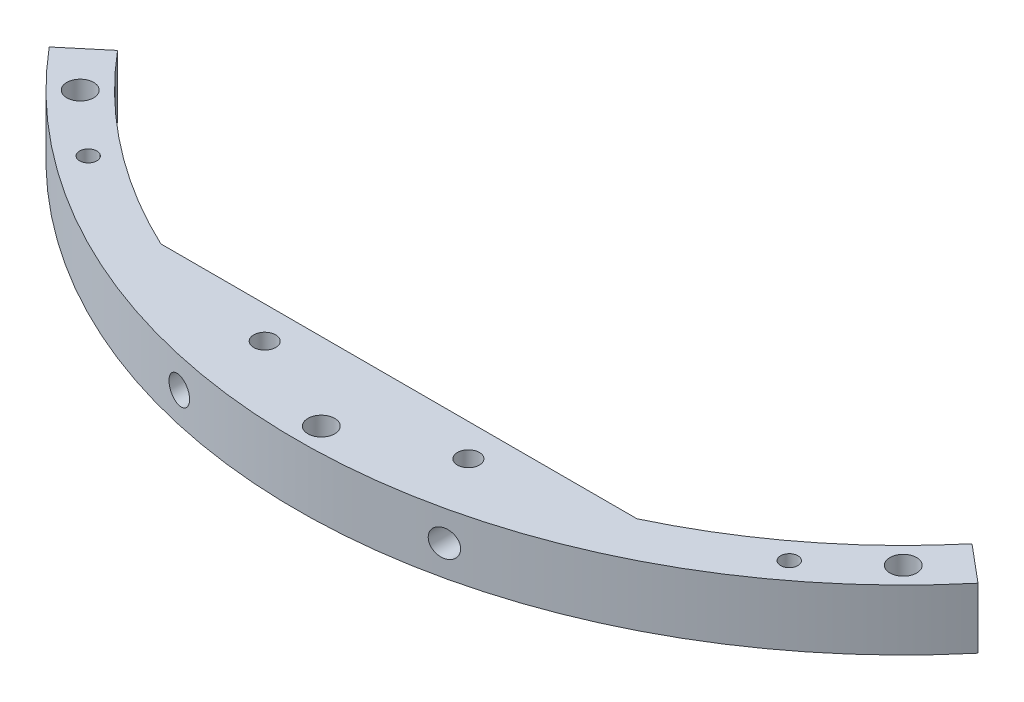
ISO-10303-21;
HEADER;
FILE_DESCRIPTION(('STEP AP214'),'2;1');
FILE_NAME('part.step','',(''),(''),'','','');
FILE_SCHEMA(('AUTOMOTIVE_DESIGN { 1 0 10303 214 1 1 1 1 }'));
ENDSEC;
DATA;
#1=APPLICATION_CONTEXT('core data for automotive mechanical design processes');
#2=APPLICATION_PROTOCOL_DEFINITION('international standard','automotive_design',2000,#1);
#3=PRODUCT_CONTEXT('',#1,'mechanical');
#4=PRODUCT('Part','Part','',(#3));
#5=PRODUCT_RELATED_PRODUCT_CATEGORY('part','',(#4));
#6=PRODUCT_DEFINITION_FORMATION('','',#4);
#7=PRODUCT_DEFINITION_CONTEXT('part definition',#1,'design');
#8=PRODUCT_DEFINITION('design','',#6,#7);
#9=PRODUCT_DEFINITION_SHAPE('','',#8);
#10=(LENGTH_UNIT() NAMED_UNIT(*) SI_UNIT(.MILLI.,.METRE.));
#11=(NAMED_UNIT(*) PLANE_ANGLE_UNIT() SI_UNIT($,.RADIAN.));
#12=(NAMED_UNIT(*) SI_UNIT($,.STERADIAN.) SOLID_ANGLE_UNIT());
#13=UNCERTAINTY_MEASURE_WITH_UNIT(LENGTH_MEASURE(1.E-05),#10,'distance_accuracy_value','');
#14=(GEOMETRIC_REPRESENTATION_CONTEXT(3) GLOBAL_UNCERTAINTY_ASSIGNED_CONTEXT((#13)) GLOBAL_UNIT_ASSIGNED_CONTEXT((#10,
#11,#12)) REPRESENTATION_CONTEXT('',''));
#15=CARTESIAN_POINT('',(0.,0.,0.));
#16=DIRECTION('',(0.,0.,1.));
#17=DIRECTION('',(1.,0.,0.));
#18=AXIS2_PLACEMENT_3D('',#15,#16,#17);
#19=CARTESIAN_POINT('',(0.,9.525,0.));
#20=DIRECTION('',(0.,1.,0.));
#21=DIRECTION('',(0.,0.,1.));
#22=AXIS2_PLACEMENT_3D('',#19,#20,#21);
#23=PLANE('',#22);
#24=CARTESIAN_POINT('',(16.002,9.525,84.328000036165));
#25=DIRECTION('',(0.,1.,0.));
#26=DIRECTION('',(0.,0.,-1.));
#27=AXIS2_PLACEMENT_3D('',#24,#25,#26);
#28=CIRCLE('',#27,1.7272);
#29=CARTESIAN_POINT('',(16.002,9.525,82.600800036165));
#30=VERTEX_POINT('',#29);
#31=EDGE_CURVE('E232',#30,#30,#28,.T.);
#32=ORIENTED_EDGE('',*,*,#31,.F.);
#33=EDGE_LOOP('',(#32));
#34=FACE_BOUND('',#33,.T.);
#35=CARTESIAN_POINT('',(-55.073032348,9.525,72.9897937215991));
#36=DIRECTION('',(0.,1.,0.));
#37=DIRECTION('',(0.,0.,1.));
#38=AXIS2_PLACEMENT_3D('',#35,#36,#37);
#39=CIRCLE('',#38,1.35254999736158);
#40=CARTESIAN_POINT('',(-55.073032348,9.525,71.6372437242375));
#41=VERTEX_POINT('',#40);
#42=EDGE_CURVE('E244',#41,#41,#39,.T.);
#43=ORIENTED_EDGE('',*,*,#42,.F.);
#44=EDGE_LOOP('',(#43));
#45=FACE_BOUND('',#44,.T.);
#46=CARTESIAN_POINT('',(55.073032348,9.525,72.9897937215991));
#47=DIRECTION('',(0.,1.,0.));
#48=DIRECTION('',(0.,0.,-1.));
#49=AXIS2_PLACEMENT_3D('',#46,#47,#48);
#50=CIRCLE('',#49,1.3525499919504);
#51=CARTESIAN_POINT('',(55.073032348,9.525,71.6372437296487));
#52=VERTEX_POINT('',#51);
#53=EDGE_CURVE('E256',#52,#52,#50,.T.);
#54=ORIENTED_EDGE('',*,*,#53,.F.);
#55=EDGE_LOOP('',(#54));
#56=FACE_BOUND('',#55,.T.);
#57=CARTESIAN_POINT('',(0.,9.525,0.));
#58=DIRECTION('',(0.,1.,0.));
#59=DIRECTION('',(0.,0.,1.));
#60=AXIS2_PLACEMENT_3D('',#57,#58,#59);
#61=CIRCLE('',#60,95.25);
#62=CARTESIAN_POINT('',(-72.9657332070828,9.525,61.2255198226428));
#63=VERTEX_POINT('',#62);
#64=CARTESIAN_POINT('',(72.9657332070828,9.525,61.2255198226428));
#65=VERTEX_POINT('',#64);
#66=EDGE_CURVE('E130',#63,#65,#61,.T.);
#67=ORIENTED_EDGE('',*,*,#66,.T.);
#68=DIRECTION('',(-0.766044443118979,0.,-0.642787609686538));
#69=VECTOR('',#68,1.);
#70=CARTESIAN_POINT('',(67.1284745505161,9.525,56.3274782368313));
#71=LINE('',#70,#69);
#72=CARTESIAN_POINT('',(67.1284745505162,9.525,56.3274782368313));
#73=VERTEX_POINT('',#72);
#74=EDGE_CURVE('E111',#65,#73,#71,.T.);
#75=ORIENTED_EDGE('',*,*,#74,.T.);
#76=CARTESIAN_POINT('',(0.,9.525,0.));
#77=DIRECTION('',(0.,-1.,0.));
#78=DIRECTION('',(0.,0.,-1.));
#79=AXIS2_PLACEMENT_3D('',#76,#77,#78);
#80=CIRCLE('',#79,87.63);
#81=CARTESIAN_POINT('',(37.400152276,9.525,79.248000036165));
#82=VERTEX_POINT('',#81);
#83=EDGE_CURVE('E133',#73,#82,#80,.T.);
#84=ORIENTED_EDGE('',*,*,#83,.T.);
#85=DIRECTION('',(-1.,0.,0.));
#86=VECTOR('',#85,1.);
#87=CARTESIAN_POINT('',(37.400152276,9.525,79.248000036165));
#88=LINE('',#87,#86);
#89=CARTESIAN_POINT('',(-37.400152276,9.525,79.248000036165));
#90=VERTEX_POINT('',#89);
#91=EDGE_CURVE('E135',#82,#90,#88,.T.);
#92=ORIENTED_EDGE('',*,*,#91,.T.);
#93=CARTESIAN_POINT('',(0.,9.525,0.));
#94=DIRECTION('',(0.,-1.,0.));
#95=DIRECTION('',(0.,0.,1.));
#96=AXIS2_PLACEMENT_3D('',#93,#94,#95);
#97=CIRCLE('',#96,87.63);
#98=CARTESIAN_POINT('',(-67.1284745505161,9.525,56.3274782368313));
#99=VERTEX_POINT('',#98);
#100=EDGE_CURVE('E64',#90,#99,#97,.T.);
#101=ORIENTED_EDGE('',*,*,#100,.T.);
#102=DIRECTION('',(-0.766044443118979,0.,0.642787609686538));
#103=VECTOR('',#102,1.);
#104=CARTESIAN_POINT('',(-67.1284745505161,9.525,56.3274782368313));
#105=LINE('',#104,#103);
#106=EDGE_CURVE('E59',#99,#63,#105,.T.);
#107=ORIENTED_EDGE('',*,*,#106,.T.);
#108=EDGE_LOOP('',(#67,#75,#84,#92,#101,#107));
#109=FACE_BOUND('',#108,.T.);
#110=CARTESIAN_POINT('',(-16.002,9.525,84.328000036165));
#111=DIRECTION('',(0.,1.,0.));
#112=DIRECTION('',(0.,0.,1.));
#113=AXIS2_PLACEMENT_3D('',#110,#111,#112);
#114=CIRCLE('',#113,1.7272);
#115=CARTESIAN_POINT('',(-16.002,9.525,82.600800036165));
#116=VERTEX_POINT('',#115);
#117=EDGE_CURVE('E116',#116,#116,#114,.T.);
#118=ORIENTED_EDGE('',*,*,#117,.F.);
#119=EDGE_LOOP('',(#118));
#120=FACE_BOUND('',#119,.T.);
#121=CARTESIAN_POINT('',(-64.657844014,9.525,64.657844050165));
#122=DIRECTION('',(0.,1.,0.));
#123=DIRECTION('',(0.,0.,1.));
#124=AXIS2_PLACEMENT_3D('',#121,#122,#123);
#125=CIRCLE('',#124,2.10819999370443);
#126=CARTESIAN_POINT('',(-64.657844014,9.525,62.5496440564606));
#127=VERTEX_POINT('',#126);
#128=EDGE_CURVE('E250',#127,#127,#125,.T.);
#129=ORIENTED_EDGE('',*,*,#128,.F.);
#130=EDGE_LOOP('',(#129));
#131=FACE_BOUND('',#130,.T.);
#132=CARTESIAN_POINT('',(64.657844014,9.525,64.657844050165));
#133=DIRECTION('',(0.,1.,0.));
#134=DIRECTION('',(0.,0.,-1.));
#135=AXIS2_PLACEMENT_3D('',#132,#133,#134);
#136=CIRCLE('',#135,2.10819999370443);
#137=CARTESIAN_POINT('',(64.657844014,9.525,62.5496440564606));
#138=VERTEX_POINT('',#137);
#139=EDGE_CURVE('E238',#138,#138,#136,.T.);
#140=ORIENTED_EDGE('',*,*,#139,.F.);
#141=EDGE_LOOP('',(#140));
#142=FACE_BOUND('',#141,.T.);
#143=CARTESIAN_POINT('',(0.,9.525,91.440000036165));
#144=DIRECTION('',(0.,1.,0.));
#145=DIRECTION('',(0.,0.,1.));
#146=AXIS2_PLACEMENT_3D('',#143,#144,#145);
#147=CIRCLE('',#146,2.1082);
#148=CARTESIAN_POINT('',(0.,9.525,89.331800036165));
#149=VERTEX_POINT('',#148);
#150=EDGE_CURVE('E226',#149,#149,#147,.T.);
#151=ORIENTED_EDGE('',*,*,#150,.F.);
#152=EDGE_LOOP('',(#151));
#153=FACE_BOUND('',#152,.T.);
#154=ADVANCED_FACE('F43',(#34,#45,#56,#109,#120,#131,#142,#153),#23,.T.);
#155=CARTESIAN_POINT('',(0.,0.,0.));
#156=DIRECTION('',(0.,1.,0.));
#157=DIRECTION('',(0.,0.,1.));
#158=AXIS2_PLACEMENT_3D('',#155,#156,#157);
#159=PLANE('',#158);
#160=CARTESIAN_POINT('',(16.002,0.,84.328000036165));
#161=DIRECTION('',(0.,1.,0.));
#162=DIRECTION('',(0.,0.,-1.));
#163=AXIS2_PLACEMENT_3D('',#160,#161,#162);
#164=CIRCLE('',#163,1.7272);
#165=CARTESIAN_POINT('',(16.002,0.,82.600800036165));
#166=VERTEX_POINT('',#165);
#167=EDGE_CURVE('E229',#166,#166,#164,.T.);
#168=ORIENTED_EDGE('',*,*,#167,.T.);
#169=EDGE_LOOP('',(#168));
#170=FACE_BOUND('',#169,.T.);
#171=CARTESIAN_POINT('',(-55.073032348,0.,72.9897937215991));
#172=DIRECTION('',(0.,1.,0.));
#173=DIRECTION('',(0.,0.,1.));
#174=AXIS2_PLACEMENT_3D('',#171,#172,#173);
#175=CIRCLE('',#174,1.35254999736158);
#176=CARTESIAN_POINT('',(-55.073032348,0.,71.6372437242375));
#177=VERTEX_POINT('',#176);
#178=EDGE_CURVE('E241',#177,#177,#175,.T.);
#179=ORIENTED_EDGE('',*,*,#178,.T.);
#180=EDGE_LOOP('',(#179));
#181=FACE_BOUND('',#180,.T.);
#182=CARTESIAN_POINT('',(55.073032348,0.,72.9897937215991));
#183=DIRECTION('',(0.,1.,0.));
#184=DIRECTION('',(0.,0.,-1.));
#185=AXIS2_PLACEMENT_3D('',#182,#183,#184);
#186=CIRCLE('',#185,1.3525499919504);
#187=CARTESIAN_POINT('',(55.073032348,0.,71.6372437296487));
#188=VERTEX_POINT('',#187);
#189=EDGE_CURVE('E253',#188,#188,#186,.T.);
#190=ORIENTED_EDGE('',*,*,#189,.T.);
#191=EDGE_LOOP('',(#190));
#192=FACE_BOUND('',#191,.T.);
#193=CARTESIAN_POINT('',(0.,0.,0.));
#194=DIRECTION('',(0.,1.,0.));
#195=DIRECTION('',(0.,0.,1.));
#196=AXIS2_PLACEMENT_3D('',#193,#194,#195);
#197=CIRCLE('',#196,95.25);
#198=CARTESIAN_POINT('',(-72.9657332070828,0.,61.2255198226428));
#199=VERTEX_POINT('',#198);
#200=CARTESIAN_POINT('',(72.9657332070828,0.,61.2255198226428));
#201=VERTEX_POINT('',#200);
#202=EDGE_CURVE('E102',#199,#201,#197,.T.);
#203=ORIENTED_EDGE('',*,*,#202,.F.);
#204=DIRECTION('',(-0.766044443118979,0.,0.642787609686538));
#205=VECTOR('',#204,1.);
#206=CARTESIAN_POINT('',(-67.1284745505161,0.,56.3274782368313));
#207=LINE('',#206,#205);
#208=CARTESIAN_POINT('',(-67.1284745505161,0.,56.3274782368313));
#209=VERTEX_POINT('',#208);
#210=EDGE_CURVE('E128',#209,#199,#207,.T.);
#211=ORIENTED_EDGE('',*,*,#210,.F.);
#212=CARTESIAN_POINT('',(0.,0.,0.));
#213=DIRECTION('',(0.,-1.,0.));
#214=DIRECTION('',(0.,0.,1.));
#215=AXIS2_PLACEMENT_3D('',#212,#213,#214);
#216=CIRCLE('',#215,87.63);
#217=CARTESIAN_POINT('',(-37.400152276,0.,79.248000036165));
#218=VERTEX_POINT('',#217);
#219=EDGE_CURVE('E126',#218,#209,#216,.T.);
#220=ORIENTED_EDGE('',*,*,#219,.F.);
#221=DIRECTION('',(-1.,0.,0.));
#222=VECTOR('',#221,1.);
#223=CARTESIAN_POINT('',(37.400152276,0.,79.248000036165));
#224=LINE('',#223,#222);
#225=CARTESIAN_POINT('',(37.400152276,0.,79.248000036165));
#226=VERTEX_POINT('',#225);
#227=EDGE_CURVE('E124',#226,#218,#224,.T.);
#228=ORIENTED_EDGE('',*,*,#227,.F.);
#229=CARTESIAN_POINT('',(0.,0.,0.));
#230=DIRECTION('',(0.,-1.,0.));
#231=DIRECTION('',(0.,0.,-1.));
#232=AXIS2_PLACEMENT_3D('',#229,#230,#231);
#233=CIRCLE('',#232,87.63);
#234=CARTESIAN_POINT('',(67.1284745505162,0.,56.3274782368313));
#235=VERTEX_POINT('',#234);
#236=EDGE_CURVE('E104',#235,#226,#233,.T.);
#237=ORIENTED_EDGE('',*,*,#236,.F.);
#238=DIRECTION('',(-0.766044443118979,0.,-0.642787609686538));
#239=VECTOR('',#238,1.);
#240=CARTESIAN_POINT('',(67.1284745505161,0.,56.3274782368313));
#241=LINE('',#240,#239);
#242=EDGE_CURVE('E97',#201,#235,#241,.T.);
#243=ORIENTED_EDGE('',*,*,#242,.F.);
#244=EDGE_LOOP('',(#203,#211,#220,#228,#237,#243));
#245=FACE_BOUND('',#244,.T.);
#246=CARTESIAN_POINT('',(-16.002,0.,84.328000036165));
#247=DIRECTION('',(0.,1.,0.));
#248=DIRECTION('',(0.,0.,1.));
#249=AXIS2_PLACEMENT_3D('',#246,#247,#248);
#250=CIRCLE('',#249,1.7272);
#251=CARTESIAN_POINT('',(-16.002,0.,82.600800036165));
#252=VERTEX_POINT('',#251);
#253=EDGE_CURVE('E119',#252,#252,#250,.T.);
#254=ORIENTED_EDGE('',*,*,#253,.T.);
#255=EDGE_LOOP('',(#254));
#256=FACE_BOUND('',#255,.T.);
#257=CARTESIAN_POINT('',(-64.657844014,0.,64.657844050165));
#258=DIRECTION('',(0.,1.,0.));
#259=DIRECTION('',(0.,0.,1.));
#260=AXIS2_PLACEMENT_3D('',#257,#258,#259);
#261=CIRCLE('',#260,2.10819999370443);
#262=CARTESIAN_POINT('',(-64.657844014,0.,62.5496440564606));
#263=VERTEX_POINT('',#262);
#264=EDGE_CURVE('E247',#263,#263,#261,.T.);
#265=ORIENTED_EDGE('',*,*,#264,.T.);
#266=EDGE_LOOP('',(#265));
#267=FACE_BOUND('',#266,.T.);
#268=CARTESIAN_POINT('',(64.657844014,0.,64.657844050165));
#269=DIRECTION('',(0.,1.,0.));
#270=DIRECTION('',(0.,0.,-1.));
#271=AXIS2_PLACEMENT_3D('',#268,#269,#270);
#272=CIRCLE('',#271,2.10819999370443);
#273=CARTESIAN_POINT('',(64.657844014,0.,62.5496440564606));
#274=VERTEX_POINT('',#273);
#275=EDGE_CURVE('E235',#274,#274,#272,.T.);
#276=ORIENTED_EDGE('',*,*,#275,.T.);
#277=EDGE_LOOP('',(#276));
#278=FACE_BOUND('',#277,.T.);
#279=CARTESIAN_POINT('',(0.,0.,91.440000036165));
#280=DIRECTION('',(0.,1.,0.));
#281=DIRECTION('',(0.,0.,1.));
#282=AXIS2_PLACEMENT_3D('',#279,#280,#281);
#283=CIRCLE('',#282,2.1082);
#284=CARTESIAN_POINT('',(0.,0.,89.331800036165));
#285=VERTEX_POINT('',#284);
#286=EDGE_CURVE('E221',#285,#285,#283,.T.);
#287=ORIENTED_EDGE('',*,*,#286,.T.);
#288=EDGE_LOOP('',(#287));
#289=FACE_BOUND('',#288,.T.);
#290=ADVANCED_FACE('F98',(#170,#181,#192,#245,#256,#267,#278,#289),#159,.F.);
#291=CARTESIAN_POINT('',(0.,9.525,0.));
#292=DIRECTION('',(0.,-1.,0.));
#293=DIRECTION('',(0.,0.,-1.));
#294=AXIS2_PLACEMENT_3D('',#291,#292,#293);
#295=CYLINDRICAL_SURFACE('',#294,95.25);
#296=CARTESIAN_POINT('',(18.7452,4.7625,93.3872581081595));
#297=CARTESIAN_POINT('',(18.7452053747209,4.87774308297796,93.387257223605));
#298=CARTESIAN_POINT('',(18.7548000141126,4.99307086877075,93.3853327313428));
#299=CARTESIAN_POINT('',(18.7929079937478,5.22052213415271,93.3776711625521));
#300=CARTESIAN_POINT('',(18.8214442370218,5.33264156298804,93.3719294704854));
#301=CARTESIAN_POINT('',(18.8965143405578,5.55031761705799,93.3567657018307));
#302=CARTESIAN_POINT('',(18.9430327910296,5.65587977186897,93.3473467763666));
#303=CARTESIAN_POINT('',(19.0526112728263,5.85759144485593,93.3250428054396));
#304=CARTESIAN_POINT('',(19.1156676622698,5.95374302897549,93.3121585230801));
#305=CARTESIAN_POINT('',(19.2569898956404,6.13482608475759,93.2830963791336));
#306=CARTESIAN_POINT('',(19.3353739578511,6.21966112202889,93.2668928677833));
#307=CARTESIAN_POINT('',(19.5046988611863,6.37499316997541,93.2316292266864));
#308=CARTESIAN_POINT('',(19.5956411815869,6.44548848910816,93.2125687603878));
#309=CARTESIAN_POINT('',(19.7892814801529,6.57156472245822,93.1716523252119));
#310=CARTESIAN_POINT('',(19.8921677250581,6.6268415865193,93.1497506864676));
#311=CARTESIAN_POINT('',(20.1053391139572,6.71936552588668,93.1039726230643));
#312=CARTESIAN_POINT('',(20.2156250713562,6.75661061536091,93.0800959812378));
#313=CARTESIAN_POINT('',(20.44290506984,6.81280318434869,93.0304462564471));
#314=CARTESIAN_POINT('',(20.5599909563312,6.83135366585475,93.0046440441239));
#315=CARTESIAN_POINT('',(20.7954479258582,6.84838897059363,92.9522802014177));
#316=CARTESIAN_POINT('',(20.9138191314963,6.8468718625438,92.9257184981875));
#317=CARTESIAN_POINT('',(21.1503305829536,6.82368481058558,92.8721752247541));
#318=CARTESIAN_POINT('',(21.2684418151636,6.80171873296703,92.8451932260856));
#319=CARTESIAN_POINT('',(21.4993117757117,6.73778339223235,92.7920046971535));
#320=CARTESIAN_POINT('',(21.6120703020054,6.69581337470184,92.765798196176));
#321=CARTESIAN_POINT('',(21.829059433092,6.59289957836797,92.714977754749));
#322=CARTESIAN_POINT('',(21.933284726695,6.5319440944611,92.6903648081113));
#323=CARTESIAN_POINT('',(22.1300111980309,6.39263671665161,92.6435930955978));
#324=CARTESIAN_POINT('',(22.2225132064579,6.31428605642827,92.6214341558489));
#325=CARTESIAN_POINT('',(22.3914790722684,6.1437173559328,92.5807302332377));
#326=CARTESIAN_POINT('',(22.4681825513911,6.05174968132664,92.5621316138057));
#327=CARTESIAN_POINT('',(22.6049583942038,5.85555406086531,92.5288243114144));
#328=CARTESIAN_POINT('',(22.6650334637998,5.751328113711,92.5141149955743));
#329=CARTESIAN_POINT('',(22.7651179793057,5.53662817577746,92.4895372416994));
#330=CARTESIAN_POINT('',(22.8056308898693,5.42640275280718,92.4795475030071));
#331=CARTESIAN_POINT('',(22.8676099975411,5.20041348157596,92.4642414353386));
#332=CARTESIAN_POINT('',(22.8890792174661,5.08465051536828,92.4589243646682));
#333=CARTESIAN_POINT('',(22.911948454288,4.85384273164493,92.4532598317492));
#334=CARTESIAN_POINT('',(22.9138156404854,4.73884681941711,92.452796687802));
#335=CARTESIAN_POINT('',(22.8986335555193,4.51019405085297,92.4565581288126));
#336=CARTESIAN_POINT('',(22.8815854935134,4.39653710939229,92.4607824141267));
#337=CARTESIAN_POINT('',(22.8293354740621,4.17460758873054,92.4736970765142));
#338=CARTESIAN_POINT('',(22.7942634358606,4.06630247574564,92.4823554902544));
#339=CARTESIAN_POINT('',(22.7071705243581,3.85717917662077,92.5037777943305));
#340=CARTESIAN_POINT('',(22.6551488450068,3.75636134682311,92.5165418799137));
#341=CARTESIAN_POINT('',(22.5349687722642,3.56359029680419,92.545888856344));
#342=CARTESIAN_POINT('',(22.4666062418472,3.47177180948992,92.5625199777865));
#343=CARTESIAN_POINT('',(22.3161742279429,3.3008715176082,92.5989030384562));
#344=CARTESIAN_POINT('',(22.2341030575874,3.22179128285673,92.6186553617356));
#345=CARTESIAN_POINT('',(22.0562931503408,3.07641641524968,92.6611622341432));
#346=CARTESIAN_POINT('',(21.9602548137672,3.01050716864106,92.6839814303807));
#347=CARTESIAN_POINT('',(21.7589076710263,2.89571072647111,92.7314570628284));
#348=CARTESIAN_POINT('',(21.6535975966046,2.84682586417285,92.7561137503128));
#349=CARTESIAN_POINT('',(21.4337978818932,2.76622592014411,92.8071540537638));
#350=CARTESIAN_POINT('',(21.319142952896,2.73497884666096,92.83356563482));
#351=CARTESIAN_POINT('',(21.0862684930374,2.69238697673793,92.8867377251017));
#352=CARTESIAN_POINT('',(20.968048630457,2.68104403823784,92.9134982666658));
#353=CARTESIAN_POINT('',(20.7297436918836,2.67856533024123,92.9669582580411));
#354=CARTESIAN_POINT('',(20.6096544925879,2.68769660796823,92.9936523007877));
#355=CARTESIAN_POINT('',(20.3725877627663,2.72655238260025,93.0458752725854));
#356=CARTESIAN_POINT('',(20.2556102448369,2.75627696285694,93.0714041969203));
#357=CARTESIAN_POINT('',(20.0286119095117,2.83547385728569,93.1205168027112));
#358=CARTESIAN_POINT('',(19.9185666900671,2.88487183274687,93.1441074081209));
#359=CARTESIAN_POINT('',(19.7082726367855,3.00217127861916,93.188830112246));
#360=CARTESIAN_POINT('',(19.6080226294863,3.07007052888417,93.2099625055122));
#361=CARTESIAN_POINT('',(19.4220388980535,3.22125127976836,93.2488916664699));
#362=CARTESIAN_POINT('',(19.3360875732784,3.30425198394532,93.2667389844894));
#363=CARTESIAN_POINT('',(19.1793547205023,3.4841222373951,93.2990957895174));
#364=CARTESIAN_POINT('',(19.1085752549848,3.580993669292,93.3136048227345));
#365=CARTESIAN_POINT('',(18.9858132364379,3.78364694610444,93.3386589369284));
#366=CARTESIAN_POINT('',(18.9334696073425,3.88920095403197,93.3492803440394));
#367=CARTESIAN_POINT('',(18.8472951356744,4.10780194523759,93.3667174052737));
#368=CARTESIAN_POINT('',(18.8134392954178,4.22083857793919,93.3735381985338));
#369=CARTESIAN_POINT('',(18.7746885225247,4.40597802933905,93.3813352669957));
#370=CARTESIAN_POINT('',(18.7636456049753,4.47680128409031,93.3835540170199));
#371=CARTESIAN_POINT('',(18.7488997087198,4.6192387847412,93.3865157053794));
#372=CARTESIAN_POINT('',(18.7451966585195,4.69085302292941,93.3872586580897));
#373=CARTESIAN_POINT('',(18.7452,4.7625,93.3872581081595));
#374=B_SPLINE_CURVE_WITH_KNOTS('',3,(#296,#297,#298,#299,#300,#301,#302,#303,#304,#305,#306,
#307,#308,#309,#310,#311,#312,#313,#314,#315,#316,#317,#318,#319,#320,#321,#322,#323,#324,#325,
#326,#327,#328,#329,#330,#331,#332,#333,#334,#335,#336,#337,#338,#339,#340,#341,#342,#343,#344,
#345,#346,#347,#348,#349,#350,#351,#352,#353,#354,#355,#356,#357,#358,#359,#360,#361,#362,#363,
#364,#365,#366,#367,#368,#369,#370,#371,#372,#373),.UNSPECIFIED.,.T.,.F.,(4,2,2,2,2,2,2,2,2,2,2,
2,2,2,2,2,2,2,2,2,2,2,2,2,2,2,2,2,2,2,2,2,2,2,2,2,2,2,4),(0.,0.345465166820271,0.69134881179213,
1.03693670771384,1.38244856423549,1.73073858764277,2.07906967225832,2.43392445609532,
2.78881831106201,3.15109921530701,3.5134149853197,3.88106066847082,4.24872021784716,
4.61660689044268,4.98446748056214,5.34625338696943,5.70798038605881,6.05982261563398,
6.41160898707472,6.75499175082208,7.09835256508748,7.43927239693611,7.7802084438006,
8.12564938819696,8.47113287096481,8.82558874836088,9.18009318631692,9.54360848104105,
9.90715770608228,10.2754762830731,10.6437963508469,11.0107376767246,11.3776349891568,
11.73830178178,12.0990175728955,12.4522140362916,12.8049317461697,13.019710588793,
13.2344873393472),.UNSPECIFIED.);
#375=CARTESIAN_POINT('',(18.7452,4.7625,93.3872581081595));
#376=VERTEX_POINT('',#375);
#377=EDGE_CURVE('E288',#376,#376,#374,.T.);
#378=ORIENTED_EDGE('',*,*,#377,.T.);
#379=EDGE_LOOP('',(#378));
#380=FACE_BOUND('',#379,.T.);
#381=CARTESIAN_POINT('',(-22.9108,4.7625,92.4535437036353));
#382=CARTESIAN_POINT('',(-22.9107945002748,4.87701433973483,92.4535452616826));
#383=CARTESIAN_POINT('',(-22.9013193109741,4.99161353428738,92.4558947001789));
#384=CARTESIAN_POINT('',(-22.8637032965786,5.21760618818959,92.4652038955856));
#385=CARTESIAN_POINT('',(-22.835539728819,5.32899556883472,92.4721692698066));
#386=CARTESIAN_POINT('',(-22.7615092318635,5.5452103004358,92.4904191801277));
#387=CARTESIAN_POINT('',(-22.7156624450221,5.65004296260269,92.5016988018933));
#388=CARTESIAN_POINT('',(-22.607736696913,5.85040809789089,92.5281352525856));
#389=CARTESIAN_POINT('',(-22.5456607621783,5.94594230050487,92.5432913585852));
#390=CARTESIAN_POINT('',(-22.4062104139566,6.12649933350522,92.5771539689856));
#391=CARTESIAN_POINT('',(-22.3286403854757,6.21136246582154,92.5959057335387));
#392=CARTESIAN_POINT('',(-22.161021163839,6.36692847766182,92.6361649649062));
#393=CARTESIAN_POINT('',(-22.0709699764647,6.43762908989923,92.6576728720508));
#394=CARTESIAN_POINT('',(-21.8782883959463,6.56489862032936,92.7033605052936));
#395=CARTESIAN_POINT('',(-21.7753814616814,6.62102847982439,92.7275971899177));
#396=CARTESIAN_POINT('',(-21.5619137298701,6.71520095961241,92.7774670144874));
#397=CARTESIAN_POINT('',(-21.4513519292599,6.75324120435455,92.8031003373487));
#398=CARTESIAN_POINT('',(-21.2230061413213,6.81096379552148,92.8555896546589));
#399=CARTESIAN_POINT('',(-21.1051153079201,6.83021096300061,92.8824601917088));
#400=CARTESIAN_POINT('',(-20.8677456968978,6.84832036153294,92.9360774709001));
#401=CARTESIAN_POINT('',(-20.7482668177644,6.84718128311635,92.9628242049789));
#402=CARTESIAN_POINT('',(-20.5101077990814,6.82439782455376,93.0156598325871));
#403=CARTESIAN_POINT('',(-20.3914417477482,6.80258908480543,93.0417417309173));
#404=CARTESIAN_POINT('',(-20.1593292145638,6.7387142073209,93.0923093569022));
#405=CARTESIAN_POINT('',(-20.0458826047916,6.69664856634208,93.116795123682));
#406=CARTESIAN_POINT('',(-19.8285263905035,6.5937409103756,93.163320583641));
#407=CARTESIAN_POINT('',(-19.7245438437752,6.53306172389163,93.1853793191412));
#408=CARTESIAN_POINT('',(-19.5282174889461,6.39438846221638,93.2267198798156));
#409=CARTESIAN_POINT('',(-19.4358725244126,6.31639610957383,93.2460019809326));
#410=CARTESIAN_POINT('',(-19.2673905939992,6.14689822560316,93.2809596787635));
#411=CARTESIAN_POINT('',(-19.1909758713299,6.05568168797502,93.296697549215));
#412=CARTESIAN_POINT('',(-19.0545868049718,5.8612089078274,93.3246488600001));
#413=CARTESIAN_POINT('',(-18.9946104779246,5.75795411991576,93.3368627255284));
#414=CARTESIAN_POINT('',(-18.8941208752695,5.54466124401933,93.3572561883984));
#415=CARTESIAN_POINT('',(-18.8532275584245,5.43480967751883,93.3655146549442));
#416=CARTESIAN_POINT('',(-18.7903989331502,5.2096018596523,93.3781797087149));
#417=CARTESIAN_POINT('',(-18.7684618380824,5.09424612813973,93.3825866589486));
#418=CARTESIAN_POINT('',(-18.744437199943,4.86312022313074,93.3874120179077));
#419=CARTESIAN_POINT('',(-18.742063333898,4.74738092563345,93.3878879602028));
#420=CARTESIAN_POINT('',(-18.7564876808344,4.51715545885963,93.3849919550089));
#421=CARTESIAN_POINT('',(-18.7732851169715,4.40266923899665,93.3816201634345));
#422=CARTESIAN_POINT('',(-18.8254082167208,4.17867500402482,93.3711261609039));
#423=CARTESIAN_POINT('',(-18.860657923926,4.06914856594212,93.3640193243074));
#424=CARTESIAN_POINT('',(-18.9485390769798,3.85762427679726,93.346223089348));
#425=CARTESIAN_POINT('',(-19.0011708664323,3.75562657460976,93.3355336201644));
#426=CARTESIAN_POINT('',(-19.1226580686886,3.56120865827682,93.3107191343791));
#427=CARTESIAN_POINT('',(-19.1916303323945,3.46886467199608,93.2965693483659));
#428=CARTESIAN_POINT('',(-19.3435113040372,3.29706547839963,93.2651975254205));
#429=CARTESIAN_POINT('',(-19.4264210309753,3.2176112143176,93.2479752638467));
#430=CARTESIAN_POINT('',(-19.6052545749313,3.07240061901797,93.2105410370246));
#431=CARTESIAN_POINT('',(-19.7013725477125,3.00689511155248,93.1902839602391));
#432=CARTESIAN_POINT('',(-19.9027547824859,2.89290945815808,93.1474822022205));
#433=CARTESIAN_POINT('',(-20.0080200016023,2.84443109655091,93.1249372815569));
#434=CARTESIAN_POINT('',(-20.2270475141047,2.76480843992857,93.0776119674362));
#435=CARTESIAN_POINT('',(-20.3409416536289,2.73404873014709,93.0527946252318));
#436=CARTESIAN_POINT('',(-20.572029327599,2.6921549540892,93.0019790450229));
#437=CARTESIAN_POINT('',(-20.6892232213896,2.68102303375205,92.9759806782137));
#438=CARTESIAN_POINT('',(-20.9257738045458,2.6785782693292,92.9230296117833));
#439=CARTESIAN_POINT('',(-21.0451322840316,2.68761741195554,92.8960681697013));
#440=CARTESIAN_POINT('',(-21.2806121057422,2.72597579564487,92.8424075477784));
#441=CARTESIAN_POINT('',(-21.3967332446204,2.75529630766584,92.8157083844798));
#442=CARTESIAN_POINT('',(-21.6231191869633,2.8336993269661,92.7632297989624));
#443=CARTESIAN_POINT('',(-21.7333463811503,2.88289475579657,92.7374565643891));
#444=CARTESIAN_POINT('',(-21.9439889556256,2.99979460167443,92.6878393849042));
#445=CARTESIAN_POINT('',(-22.0444050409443,3.0674976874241,92.6639953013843));
#446=CARTESIAN_POINT('',(-22.2312962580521,3.21876948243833,92.6193344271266));
#447=CARTESIAN_POINT('',(-22.3179172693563,3.30214852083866,92.5984862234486));
#448=CARTESIAN_POINT('',(-22.4758689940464,3.4830484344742,92.5602746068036));
#449=CARTESIAN_POINT('',(-22.547197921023,3.58057095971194,92.5429116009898));
#450=CARTESIAN_POINT('',(-22.670610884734,3.78439435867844,92.5127550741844));
#451=CARTESIAN_POINT('',(-22.7231267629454,3.8904189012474,92.4998592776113));
#452=CARTESIAN_POINT('',(-22.8095043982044,4.11012897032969,92.4785975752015));
#453=CARTESIAN_POINT('',(-22.8433930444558,4.22380318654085,92.47022514));
#454=CARTESIAN_POINT('',(-22.8818157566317,4.40902220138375,92.4607225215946));
#455=CARTESIAN_POINT('',(-22.8926690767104,4.47923945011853,92.4580351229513));
#456=CARTESIAN_POINT('',(-22.9071628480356,4.62046025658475,92.4544452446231));
#457=CARTESIAN_POINT('',(-22.9108034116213,4.69146380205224,92.4535427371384));
#458=CARTESIAN_POINT('',(-22.9108,4.7625,92.4535437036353));
#459=B_SPLINE_CURVE_WITH_KNOTS('',3,(#381,#382,#383,#384,#385,#386,#387,#388,#389,#390,#391,
#392,#393,#394,#395,#396,#397,#398,#399,#400,#401,#402,#403,#404,#405,#406,#407,#408,#409,#410,
#411,#412,#413,#414,#415,#416,#417,#418,#419,#420,#421,#422,#423,#424,#425,#426,#427,#428,#429,
#430,#431,#432,#433,#434,#435,#436,#437,#438,#439,#440,#441,#442,#443,#444,#445,#446,#447,#448,
#449,#450,#451,#452,#453,#454,#455,#456,#457,#458),.UNSPECIFIED.,.T.,.F.,(4,2,2,2,2,2,2,2,2,2,2,
2,2,2,2,2,2,2,2,2,2,2,2,2,2,2,2,2,2,2,2,2,2,2,2,2,2,2,4),(0.,0.34327933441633,0.686977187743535,
1.03028469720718,1.37352822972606,1.72141560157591,2.06935862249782,2.4268115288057,
2.78431136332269,3.14990602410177,3.51552416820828,3.88407421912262,4.25261523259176,
4.61802005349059,4.98338853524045,5.34172447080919,5.70001715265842,6.05083289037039,
6.40161555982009,6.74725496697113,7.09288036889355,7.43709410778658,7.78131465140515,
8.12807525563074,8.47486122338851,8.82743659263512,9.18004889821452,9.54005133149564,
9.90009312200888,10.2664667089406,10.6328632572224,11.0013714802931,11.369853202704,
11.7341341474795,12.0984576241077,12.4537820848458,12.8085922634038,13.0215406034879,
13.2344856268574),.UNSPECIFIED.);
#460=CARTESIAN_POINT('',(-22.9108,4.7625,92.4535437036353));
#461=VERTEX_POINT('',#460);
#462=EDGE_CURVE('E215',#461,#461,#459,.T.);
#463=ORIENTED_EDGE('',*,*,#462,.T.);
#464=EDGE_LOOP('',(#463));
#465=FACE_BOUND('',#464,.T.);
#466=ORIENTED_EDGE('',*,*,#202,.T.);
#467=DIRECTION('',(0.,-1.,0.));
#468=VECTOR('',#467,1.);
#469=CARTESIAN_POINT('',(72.9657332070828,9.525,61.2255198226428));
#470=LINE('',#469,#468);
#471=EDGE_CURVE('E13',#65,#201,#470,.T.);
#472=ORIENTED_EDGE('',*,*,#471,.F.);
#473=ORIENTED_EDGE('',*,*,#66,.F.);
#474=DIRECTION('',(0.,-1.,0.));
#475=VECTOR('',#474,1.);
#476=CARTESIAN_POINT('',(-72.9657332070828,9.525,61.2255198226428));
#477=LINE('',#476,#475);
#478=EDGE_CURVE('E115',#63,#199,#477,.T.);
#479=ORIENTED_EDGE('',*,*,#478,.T.);
#480=EDGE_LOOP('',(#466,#472,#473,#479));
#481=FACE_BOUND('',#480,.T.);
#482=ADVANCED_FACE('F45',(#380,#465,#481),#295,.T.);
#483=CARTESIAN_POINT('',(67.1284745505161,9.525,56.3274782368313));
#484=DIRECTION('',(-0.642787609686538,0.,0.766044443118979));
#485=DIRECTION('',(0.766044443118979,0.,0.642787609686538));
#486=AXIS2_PLACEMENT_3D('',#483,#484,#485);
#487=PLANE('',#486);
#488=ORIENTED_EDGE('',*,*,#242,.T.);
#489=DIRECTION('',(0.,-1.,0.));
#490=VECTOR('',#489,1.);
#491=CARTESIAN_POINT('',(67.1284745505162,9.525,56.3274782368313));
#492=LINE('',#491,#490);
#493=EDGE_CURVE('E52',#73,#235,#492,.T.);
#494=ORIENTED_EDGE('',*,*,#493,.F.);
#495=ORIENTED_EDGE('',*,*,#74,.F.);
#496=ORIENTED_EDGE('',*,*,#471,.T.);
#497=EDGE_LOOP('',(#488,#494,#495,#496));
#498=FACE_BOUND('',#497,.T.);
#499=ADVANCED_FACE('F110',(#498),#487,.F.);
#500=CARTESIAN_POINT('',(0.,9.525,0.));
#501=DIRECTION('',(0.,-1.,0.));
#502=DIRECTION('',(0.,0.,-1.));
#503=AXIS2_PLACEMENT_3D('',#500,#501,#502);
#504=CYLINDRICAL_SURFACE('',#503,87.63);
#505=ORIENTED_EDGE('',*,*,#236,.T.);
#506=DIRECTION('',(0.,-1.,0.));
#507=VECTOR('',#506,1.);
#508=CARTESIAN_POINT('',(37.400152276,9.525,79.248000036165));
#509=LINE('',#508,#507);
#510=EDGE_CURVE('E146',#82,#226,#509,.T.);
#511=ORIENTED_EDGE('',*,*,#510,.F.);
#512=ORIENTED_EDGE('',*,*,#83,.F.);
#513=ORIENTED_EDGE('',*,*,#493,.T.);
#514=EDGE_LOOP('',(#505,#511,#512,#513));
#515=FACE_BOUND('',#514,.T.);
#516=ADVANCED_FACE('F150',(#515),#504,.F.);
#517=CARTESIAN_POINT('',(37.400152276,9.525,79.248000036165));
#518=DIRECTION('',(0.,0.,1.));
#519=DIRECTION('',(1.,0.,0.));
#520=AXIS2_PLACEMENT_3D('',#517,#518,#519);
#521=PLANE('',#520);
#522=CARTESIAN_POINT('',(20.828,4.7625,79.248000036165));
#523=DIRECTION('',(0.,0.,-1.));
#524=DIRECTION('',(1.,0.,0.));
#525=AXIS2_PLACEMENT_3D('',#522,#523,#524);
#526=CIRCLE('',#525,2.0828);
#527=CARTESIAN_POINT('',(22.9108,4.7625,79.248000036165));
#528=VERTEX_POINT('',#527);
#529=EDGE_CURVE('E293',#528,#528,#526,.T.);
#530=ORIENTED_EDGE('',*,*,#529,.F.);
#531=EDGE_LOOP('',(#530));
#532=FACE_BOUND('',#531,.T.);
#533=CARTESIAN_POINT('',(-20.828,4.7625,79.248000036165));
#534=DIRECTION('',(0.,0.,-1.));
#535=DIRECTION('',(-1.,0.,0.));
#536=AXIS2_PLACEMENT_3D('',#533,#534,#535);
#537=CIRCLE('',#536,2.0828);
#538=CARTESIAN_POINT('',(-22.9108,4.7625,79.248000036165));
#539=VERTEX_POINT('',#538);
#540=EDGE_CURVE('E222',#539,#539,#537,.T.);
#541=ORIENTED_EDGE('',*,*,#540,.F.);
#542=EDGE_LOOP('',(#541));
#543=FACE_BOUND('',#542,.T.);
#544=ORIENTED_EDGE('',*,*,#227,.T.);
#545=DIRECTION('',(0.,-1.,0.));
#546=VECTOR('',#545,1.);
#547=CARTESIAN_POINT('',(-37.400152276,9.525,79.248000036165));
#548=LINE('',#547,#546);
#549=EDGE_CURVE('E143',#90,#218,#548,.T.);
#550=ORIENTED_EDGE('',*,*,#549,.F.);
#551=ORIENTED_EDGE('',*,*,#91,.F.);
#552=ORIENTED_EDGE('',*,*,#510,.T.);
#553=EDGE_LOOP('',(#544,#550,#551,#552));
#554=FACE_BOUND('',#553,.T.);
#555=ADVANCED_FACE('F156',(#532,#543,#554),#521,.F.);
#556=CARTESIAN_POINT('',(0.,9.525,0.));
#557=DIRECTION('',(0.,-1.,0.));
#558=DIRECTION('',(0.,0.,-1.));
#559=AXIS2_PLACEMENT_3D('',#556,#557,#558);
#560=CYLINDRICAL_SURFACE('',#559,87.63);
#561=ORIENTED_EDGE('',*,*,#219,.T.);
#562=DIRECTION('',(0.,-1.,0.));
#563=VECTOR('',#562,1.);
#564=CARTESIAN_POINT('',(-67.1284745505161,9.525,56.3274782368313));
#565=LINE('',#564,#563);
#566=EDGE_CURVE('E140',#99,#209,#565,.T.);
#567=ORIENTED_EDGE('',*,*,#566,.F.);
#568=ORIENTED_EDGE('',*,*,#100,.F.);
#569=ORIENTED_EDGE('',*,*,#549,.T.);
#570=EDGE_LOOP('',(#561,#567,#568,#569));
#571=FACE_BOUND('',#570,.T.);
#572=ADVANCED_FACE('F159',(#571),#560,.F.);
#573=CARTESIAN_POINT('',(-67.1284745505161,9.525,56.3274782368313));
#574=DIRECTION('',(0.642787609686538,0.,0.766044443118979));
#575=DIRECTION('',(0.766044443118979,0.,-0.642787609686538));
#576=AXIS2_PLACEMENT_3D('',#573,#574,#575);
#577=PLANE('',#576);
#578=ORIENTED_EDGE('',*,*,#210,.T.);
#579=ORIENTED_EDGE('',*,*,#478,.F.);
#580=ORIENTED_EDGE('',*,*,#106,.F.);
#581=ORIENTED_EDGE('',*,*,#566,.T.);
#582=EDGE_LOOP('',(#578,#579,#580,#581));
#583=FACE_BOUND('',#582,.T.);
#584=ADVANCED_FACE('F161',(#583),#577,.F.);
#585=CARTESIAN_POINT('',(-16.002,9.525,84.328000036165));
#586=DIRECTION('',(0.,-1.,0.));
#587=DIRECTION('',(0.,0.,-1.));
#588=AXIS2_PLACEMENT_3D('',#585,#586,#587);
#589=CYLINDRICAL_SURFACE('',#588,1.7272);
#590=CARTESIAN_POINT('',(-16.002,9.525,82.600800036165));
#591=CARTESIAN_POINT('',(-16.002,9.42578125,82.600800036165));
#592=CARTESIAN_POINT('',(-16.002,9.3265625,82.600800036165));
#593=CARTESIAN_POINT('',(-16.002,9.128125,82.600800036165));
#594=CARTESIAN_POINT('',(-16.002,9.02890625,82.600800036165));
#595=CARTESIAN_POINT('',(-16.002,8.83046875,82.600800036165));
#596=CARTESIAN_POINT('',(-16.002,8.73125,82.600800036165));
#597=CARTESIAN_POINT('',(-16.002,8.5328125,82.600800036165));
#598=CARTESIAN_POINT('',(-16.002,8.43359375,82.600800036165));
#599=CARTESIAN_POINT('',(-16.002,8.23515625,82.600800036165));
#600=CARTESIAN_POINT('',(-16.002,8.1359375,82.600800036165));
#601=CARTESIAN_POINT('',(-16.002,7.9375,82.600800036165));
#602=CARTESIAN_POINT('',(-16.002,7.83828125,82.600800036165));
#603=CARTESIAN_POINT('',(-16.002,7.63984375,82.600800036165));
#604=CARTESIAN_POINT('',(-16.002,7.540625,82.600800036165));
#605=CARTESIAN_POINT('',(-16.002,7.3421875,82.600800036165));
#606=CARTESIAN_POINT('',(-16.002,7.24296875,82.600800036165));
#607=CARTESIAN_POINT('',(-16.002,7.04453125,82.600800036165));
#608=CARTESIAN_POINT('',(-16.002,6.9453125,82.600800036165));
#609=CARTESIAN_POINT('',(-16.002,6.746875,82.600800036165));
#610=CARTESIAN_POINT('',(-16.002,6.64765625,82.600800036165));
#611=CARTESIAN_POINT('',(-16.002,6.44921875,82.600800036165));
#612=CARTESIAN_POINT('',(-16.002,6.35,82.600800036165));
#613=CARTESIAN_POINT('',(-16.002,6.1515625,82.600800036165));
#614=CARTESIAN_POINT('',(-16.002,6.05234375,82.600800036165));
#615=CARTESIAN_POINT('',(-16.002,5.85390625,82.600800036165));
#616=CARTESIAN_POINT('',(-16.002,5.7546875,82.600800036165));
#617=CARTESIAN_POINT('',(-16.002,5.55625,82.600800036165));
#618=CARTESIAN_POINT('',(-16.002,5.45703125,82.600800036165));
#619=CARTESIAN_POINT('',(-16.002,5.25859375,82.600800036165));
#620=CARTESIAN_POINT('',(-16.002,5.159375,82.600800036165));
#621=CARTESIAN_POINT('',(-16.002,4.9609375,82.600800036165));
#622=CARTESIAN_POINT('',(-16.002,4.86171875,82.600800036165));
#623=CARTESIAN_POINT('',(-16.002,4.66328125,82.600800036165));
#624=CARTESIAN_POINT('',(-16.002,4.5640625,82.600800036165));
#625=CARTESIAN_POINT('',(-16.002,4.365625,82.600800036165));
#626=CARTESIAN_POINT('',(-16.002,4.26640625,82.600800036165));
#627=CARTESIAN_POINT('',(-16.002,4.06796875,82.600800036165));
#628=CARTESIAN_POINT('',(-16.002,3.96875,82.600800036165));
#629=CARTESIAN_POINT('',(-16.002,3.7703125,82.600800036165));
#630=CARTESIAN_POINT('',(-16.002,3.67109375,82.600800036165));
#631=CARTESIAN_POINT('',(-16.002,3.47265625,82.600800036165));
#632=CARTESIAN_POINT('',(-16.002,3.3734375,82.600800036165));
#633=CARTESIAN_POINT('',(-16.002,3.175,82.600800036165));
#634=CARTESIAN_POINT('',(-16.002,3.07578125,82.600800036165));
#635=CARTESIAN_POINT('',(-16.002,2.87734375,82.600800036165));
#636=CARTESIAN_POINT('',(-16.002,2.778125,82.600800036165));
#637=CARTESIAN_POINT('',(-16.002,2.5796875,82.600800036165));
#638=CARTESIAN_POINT('',(-16.002,2.48046875,82.600800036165));
#639=CARTESIAN_POINT('',(-16.002,2.28203125,82.600800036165));
#640=CARTESIAN_POINT('',(-16.002,2.1828125,82.600800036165));
#641=CARTESIAN_POINT('',(-16.002,1.984375,82.600800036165));
#642=CARTESIAN_POINT('',(-16.002,1.88515625,82.600800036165));
#643=CARTESIAN_POINT('',(-16.002,1.68671875,82.600800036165));
#644=CARTESIAN_POINT('',(-16.002,1.5875,82.600800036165));
#645=CARTESIAN_POINT('',(-16.002,1.3890625,82.600800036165));
#646=CARTESIAN_POINT('',(-16.002,1.28984375,82.600800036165));
#647=CARTESIAN_POINT('',(-16.002,1.09140625,82.600800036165));
#648=CARTESIAN_POINT('',(-16.002,0.992187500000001,82.600800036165));
#649=CARTESIAN_POINT('',(-16.002,0.793750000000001,82.600800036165));
#650=CARTESIAN_POINT('',(-16.002,0.69453125,82.600800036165));
#651=CARTESIAN_POINT('',(-16.002,0.49609375,82.600800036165));
#652=CARTESIAN_POINT('',(-16.002,0.396875,82.600800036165));
#653=CARTESIAN_POINT('',(-16.002,0.1984375,82.600800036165));
#654=CARTESIAN_POINT('',(-16.002,0.0992187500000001,82.600800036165));
#655=CARTESIAN_POINT('',(-16.002,0.,82.600800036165));
#656=B_SPLINE_CURVE_WITH_KNOTS('',3,(#590,#591,#592,#593,#594,#595,#596,#597,#598,#599,#600,
#601,#602,#603,#604,#605,#606,#607,#608,#609,#610,#611,#612,#613,#614,#615,#616,#617,#618,#619,
#620,#621,#622,#623,#624,#625,#626,#627,#628,#629,#630,#631,#632,#633,#634,#635,#636,#637,#638,
#639,#640,#641,#642,#643,#644,#645,#646,#647,#648,#649,#650,#651,#652,#653,#654,#655),
.UNSPECIFIED.,.F.,.F.,(4,2,2,2,2,2,2,2,2,2,2,2,2,2,2,2,2,2,2,2,2,2,2,2,2,2,2,2,2,2,2,2,4),(0.,
0.29765625,0.5953125,0.892968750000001,1.190625,1.48828125,1.7859375,2.08359375,2.38125,
2.67890625,2.9765625,3.27421875,3.571875,3.86953125,4.1671875,4.46484375,4.7625,5.06015625,
5.3578125,5.65546875,5.953125,6.25078125,6.5484375,6.84609375,7.14375,7.44140625,7.7390625,
8.03671875,8.334375,8.63203125,8.9296875,9.22734375,9.525),.UNSPECIFIED.);
#657=EDGE_CURVE('BSEAM163',#116,#252,#656,.T.);
#658=ORIENTED_EDGE('',*,*,#117,.T.);
#659=ORIENTED_EDGE('',*,*,#253,.F.);
#660=ORIENTED_EDGE('',*,*,#657,.T.);
#661=ORIENTED_EDGE('',*,*,#657,.F.);
#662=EDGE_LOOP('',(#658,#660,#659,#661));
#663=FACE_BOUND('',#662,.T.);
#664=ADVANCED_FACE('F163',(#663),#589,.F.);
#665=CARTESIAN_POINT('',(55.073032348,9.525,72.9897937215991));
#666=DIRECTION('',(0.,-1.,0.));
#667=DIRECTION('',(0.,0.,-1.));
#668=AXIS2_PLACEMENT_3D('',#665,#666,#667);
#669=CYLINDRICAL_SURFACE('',#668,1.3525499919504);
#670=CARTESIAN_POINT('',(55.073032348,9.525,71.6372437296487));
#671=CARTESIAN_POINT('',(55.073032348,9.42578125,71.6372437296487));
#672=CARTESIAN_POINT('',(55.073032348,9.3265625,71.6372437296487));
#673=CARTESIAN_POINT('',(55.073032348,9.128125,71.6372437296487));
#674=CARTESIAN_POINT('',(55.073032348,9.02890625,71.6372437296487));
#675=CARTESIAN_POINT('',(55.073032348,8.83046875,71.6372437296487));
#676=CARTESIAN_POINT('',(55.073032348,8.73125,71.6372437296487));
#677=CARTESIAN_POINT('',(55.073032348,8.5328125,71.6372437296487));
#678=CARTESIAN_POINT('',(55.073032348,8.43359375,71.6372437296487));
#679=CARTESIAN_POINT('',(55.073032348,8.23515625,71.6372437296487));
#680=CARTESIAN_POINT('',(55.073032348,8.1359375,71.6372437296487));
#681=CARTESIAN_POINT('',(55.073032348,7.9375,71.6372437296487));
#682=CARTESIAN_POINT('',(55.073032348,7.83828125,71.6372437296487));
#683=CARTESIAN_POINT('',(55.073032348,7.63984375,71.6372437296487));
#684=CARTESIAN_POINT('',(55.073032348,7.540625,71.6372437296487));
#685=CARTESIAN_POINT('',(55.073032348,7.3421875,71.6372437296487));
#686=CARTESIAN_POINT('',(55.073032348,7.24296875,71.6372437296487));
#687=CARTESIAN_POINT('',(55.073032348,7.04453125,71.6372437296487));
#688=CARTESIAN_POINT('',(55.073032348,6.9453125,71.6372437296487));
#689=CARTESIAN_POINT('',(55.073032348,6.746875,71.6372437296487));
#690=CARTESIAN_POINT('',(55.073032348,6.64765625,71.6372437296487));
#691=CARTESIAN_POINT('',(55.073032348,6.44921875,71.6372437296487));
#692=CARTESIAN_POINT('',(55.073032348,6.35,71.6372437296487));
#693=CARTESIAN_POINT('',(55.073032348,6.1515625,71.6372437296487));
#694=CARTESIAN_POINT('',(55.073032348,6.05234375,71.6372437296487));
#695=CARTESIAN_POINT('',(55.073032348,5.85390625,71.6372437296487));
#696=CARTESIAN_POINT('',(55.073032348,5.7546875,71.6372437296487));
#697=CARTESIAN_POINT('',(55.073032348,5.55625,71.6372437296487));
#698=CARTESIAN_POINT('',(55.073032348,5.45703125,71.6372437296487));
#699=CARTESIAN_POINT('',(55.073032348,5.25859375,71.6372437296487));
#700=CARTESIAN_POINT('',(55.073032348,5.159375,71.6372437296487));
#701=CARTESIAN_POINT('',(55.073032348,4.9609375,71.6372437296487));
#702=CARTESIAN_POINT('',(55.073032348,4.86171875,71.6372437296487));
#703=CARTESIAN_POINT('',(55.073032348,4.66328125,71.6372437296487));
#704=CARTESIAN_POINT('',(55.073032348,4.5640625,71.6372437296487));
#705=CARTESIAN_POINT('',(55.073032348,4.365625,71.6372437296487));
#706=CARTESIAN_POINT('',(55.073032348,4.26640625,71.6372437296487));
#707=CARTESIAN_POINT('',(55.073032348,4.06796875,71.6372437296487));
#708=CARTESIAN_POINT('',(55.073032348,3.96875,71.6372437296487));
#709=CARTESIAN_POINT('',(55.073032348,3.7703125,71.6372437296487));
#710=CARTESIAN_POINT('',(55.073032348,3.67109375,71.6372437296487));
#711=CARTESIAN_POINT('',(55.073032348,3.47265625,71.6372437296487));
#712=CARTESIAN_POINT('',(55.073032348,3.3734375,71.6372437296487));
#713=CARTESIAN_POINT('',(55.073032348,3.175,71.6372437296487));
#714=CARTESIAN_POINT('',(55.073032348,3.07578125,71.6372437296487));
#715=CARTESIAN_POINT('',(55.073032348,2.87734375,71.6372437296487));
#716=CARTESIAN_POINT('',(55.073032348,2.778125,71.6372437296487));
#717=CARTESIAN_POINT('',(55.073032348,2.5796875,71.6372437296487));
#718=CARTESIAN_POINT('',(55.073032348,2.48046875,71.6372437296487));
#719=CARTESIAN_POINT('',(55.073032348,2.28203125,71.6372437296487));
#720=CARTESIAN_POINT('',(55.073032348,2.1828125,71.6372437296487));
#721=CARTESIAN_POINT('',(55.073032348,1.984375,71.6372437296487));
#722=CARTESIAN_POINT('',(55.073032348,1.88515625,71.6372437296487));
#723=CARTESIAN_POINT('',(55.073032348,1.68671875,71.6372437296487));
#724=CARTESIAN_POINT('',(55.073032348,1.5875,71.6372437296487));
#725=CARTESIAN_POINT('',(55.073032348,1.3890625,71.6372437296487));
#726=CARTESIAN_POINT('',(55.073032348,1.28984375,71.6372437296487));
#727=CARTESIAN_POINT('',(55.073032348,1.09140625,71.6372437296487));
#728=CARTESIAN_POINT('',(55.073032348,0.992187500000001,71.6372437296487));
#729=CARTESIAN_POINT('',(55.073032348,0.793750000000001,71.6372437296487));
#730=CARTESIAN_POINT('',(55.073032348,0.69453125,71.6372437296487));
#731=CARTESIAN_POINT('',(55.073032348,0.49609375,71.6372437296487));
#732=CARTESIAN_POINT('',(55.073032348,0.396875,71.6372437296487));
#733=CARTESIAN_POINT('',(55.073032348,0.1984375,71.6372437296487));
#734=CARTESIAN_POINT('',(55.073032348,0.0992187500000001,71.6372437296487));
#735=CARTESIAN_POINT('',(55.073032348,0.,71.6372437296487));
#736=B_SPLINE_CURVE_WITH_KNOTS('',3,(#670,#671,#672,#673,#674,#675,#676,#677,#678,#679,#680,
#681,#682,#683,#684,#685,#686,#687,#688,#689,#690,#691,#692,#693,#694,#695,#696,#697,#698,#699,
#700,#701,#702,#703,#704,#705,#706,#707,#708,#709,#710,#711,#712,#713,#714,#715,#716,#717,#718,
#719,#720,#721,#722,#723,#724,#725,#726,#727,#728,#729,#730,#731,#732,#733,#734,#735),
.UNSPECIFIED.,.F.,.F.,(4,2,2,2,2,2,2,2,2,2,2,2,2,2,2,2,2,2,2,2,2,2,2,2,2,2,2,2,2,2,2,2,4),(0.,
0.29765625,0.5953125,0.892968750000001,1.190625,1.48828125,1.7859375,2.08359375,2.38125,
2.67890625,2.9765625,3.27421875,3.571875,3.86953125,4.1671875,4.46484375,4.7625,5.06015625,
5.3578125,5.65546875,5.953125,6.25078125,6.5484375,6.84609375,7.14375,7.44140625,7.7390625,
8.03671875,8.334375,8.63203125,8.9296875,9.22734375,9.525),.UNSPECIFIED.);
#737=EDGE_CURVE('BSEAM169',#52,#188,#736,.T.);
#738=ORIENTED_EDGE('',*,*,#53,.T.);
#739=ORIENTED_EDGE('',*,*,#189,.F.);
#740=ORIENTED_EDGE('',*,*,#737,.T.);
#741=ORIENTED_EDGE('',*,*,#737,.F.);
#742=EDGE_LOOP('',(#738,#740,#739,#741));
#743=FACE_BOUND('',#742,.T.);
#744=ADVANCED_FACE('F169',(#743),#669,.F.);
#745=CARTESIAN_POINT('',(-64.657844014,9.525,64.657844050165));
#746=DIRECTION('',(0.,-1.,0.));
#747=DIRECTION('',(0.,0.,-1.));
#748=AXIS2_PLACEMENT_3D('',#745,#746,#747);
#749=CYLINDRICAL_SURFACE('',#748,2.10819999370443);
#750=CARTESIAN_POINT('',(-64.657844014,9.525,62.5496440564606));
#751=CARTESIAN_POINT('',(-64.657844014,9.42578125,62.5496440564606));
#752=CARTESIAN_POINT('',(-64.657844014,9.3265625,62.5496440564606));
#753=CARTESIAN_POINT('',(-64.657844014,9.128125,62.5496440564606));
#754=CARTESIAN_POINT('',(-64.657844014,9.02890625,62.5496440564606));
#755=CARTESIAN_POINT('',(-64.657844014,8.83046875,62.5496440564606));
#756=CARTESIAN_POINT('',(-64.657844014,8.73125,62.5496440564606));
#757=CARTESIAN_POINT('',(-64.657844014,8.5328125,62.5496440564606));
#758=CARTESIAN_POINT('',(-64.657844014,8.43359375,62.5496440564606));
#759=CARTESIAN_POINT('',(-64.657844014,8.23515625,62.5496440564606));
#760=CARTESIAN_POINT('',(-64.657844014,8.1359375,62.5496440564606));
#761=CARTESIAN_POINT('',(-64.657844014,7.9375,62.5496440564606));
#762=CARTESIAN_POINT('',(-64.657844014,7.83828125,62.5496440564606));
#763=CARTESIAN_POINT('',(-64.657844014,7.63984375,62.5496440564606));
#764=CARTESIAN_POINT('',(-64.657844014,7.540625,62.5496440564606));
#765=CARTESIAN_POINT('',(-64.657844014,7.3421875,62.5496440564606));
#766=CARTESIAN_POINT('',(-64.657844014,7.24296875,62.5496440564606));
#767=CARTESIAN_POINT('',(-64.657844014,7.04453125,62.5496440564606));
#768=CARTESIAN_POINT('',(-64.657844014,6.9453125,62.5496440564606));
#769=CARTESIAN_POINT('',(-64.657844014,6.746875,62.5496440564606));
#770=CARTESIAN_POINT('',(-64.657844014,6.64765625,62.5496440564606));
#771=CARTESIAN_POINT('',(-64.657844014,6.44921875,62.5496440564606));
#772=CARTESIAN_POINT('',(-64.657844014,6.35,62.5496440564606));
#773=CARTESIAN_POINT('',(-64.657844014,6.1515625,62.5496440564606));
#774=CARTESIAN_POINT('',(-64.657844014,6.05234375,62.5496440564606));
#775=CARTESIAN_POINT('',(-64.657844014,5.85390625,62.5496440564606));
#776=CARTESIAN_POINT('',(-64.657844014,5.7546875,62.5496440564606));
#777=CARTESIAN_POINT('',(-64.657844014,5.55625,62.5496440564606));
#778=CARTESIAN_POINT('',(-64.657844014,5.45703125,62.5496440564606));
#779=CARTESIAN_POINT('',(-64.657844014,5.25859375,62.5496440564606));
#780=CARTESIAN_POINT('',(-64.657844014,5.159375,62.5496440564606));
#781=CARTESIAN_POINT('',(-64.657844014,4.9609375,62.5496440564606));
#782=CARTESIAN_POINT('',(-64.657844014,4.86171875,62.5496440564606));
#783=CARTESIAN_POINT('',(-64.657844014,4.66328125,62.5496440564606));
#784=CARTESIAN_POINT('',(-64.657844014,4.5640625,62.5496440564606));
#785=CARTESIAN_POINT('',(-64.657844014,4.365625,62.5496440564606));
#786=CARTESIAN_POINT('',(-64.657844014,4.26640625,62.5496440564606));
#787=CARTESIAN_POINT('',(-64.657844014,4.06796875,62.5496440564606));
#788=CARTESIAN_POINT('',(-64.657844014,3.96875,62.5496440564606));
#789=CARTESIAN_POINT('',(-64.657844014,3.7703125,62.5496440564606));
#790=CARTESIAN_POINT('',(-64.657844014,3.67109375,62.5496440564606));
#791=CARTESIAN_POINT('',(-64.657844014,3.47265625,62.5496440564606));
#792=CARTESIAN_POINT('',(-64.657844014,3.3734375,62.5496440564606));
#793=CARTESIAN_POINT('',(-64.657844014,3.175,62.5496440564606));
#794=CARTESIAN_POINT('',(-64.657844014,3.07578125,62.5496440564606));
#795=CARTESIAN_POINT('',(-64.657844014,2.87734375,62.5496440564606));
#796=CARTESIAN_POINT('',(-64.657844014,2.778125,62.5496440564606));
#797=CARTESIAN_POINT('',(-64.657844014,2.5796875,62.5496440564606));
#798=CARTESIAN_POINT('',(-64.657844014,2.48046875,62.5496440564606));
#799=CARTESIAN_POINT('',(-64.657844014,2.28203125,62.5496440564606));
#800=CARTESIAN_POINT('',(-64.657844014,2.1828125,62.5496440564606));
#801=CARTESIAN_POINT('',(-64.657844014,1.984375,62.5496440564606));
#802=CARTESIAN_POINT('',(-64.657844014,1.88515625,62.5496440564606));
#803=CARTESIAN_POINT('',(-64.657844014,1.68671875,62.5496440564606));
#804=CARTESIAN_POINT('',(-64.657844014,1.5875,62.5496440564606));
#805=CARTESIAN_POINT('',(-64.657844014,1.3890625,62.5496440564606));
#806=CARTESIAN_POINT('',(-64.657844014,1.28984375,62.5496440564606));
#807=CARTESIAN_POINT('',(-64.657844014,1.09140625,62.5496440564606));
#808=CARTESIAN_POINT('',(-64.657844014,0.992187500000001,62.5496440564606));
#809=CARTESIAN_POINT('',(-64.657844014,0.793750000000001,62.5496440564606));
#810=CARTESIAN_POINT('',(-64.657844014,0.69453125,62.5496440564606));
#811=CARTESIAN_POINT('',(-64.657844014,0.49609375,62.5496440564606));
#812=CARTESIAN_POINT('',(-64.657844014,0.396875,62.5496440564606));
#813=CARTESIAN_POINT('',(-64.657844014,0.1984375,62.5496440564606));
#814=CARTESIAN_POINT('',(-64.657844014,0.0992187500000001,62.5496440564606));
#815=CARTESIAN_POINT('',(-64.657844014,0.,62.5496440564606));
#816=B_SPLINE_CURVE_WITH_KNOTS('',3,(#750,#751,#752,#753,#754,#755,#756,#757,#758,#759,#760,
#761,#762,#763,#764,#765,#766,#767,#768,#769,#770,#771,#772,#773,#774,#775,#776,#777,#778,#779,
#780,#781,#782,#783,#784,#785,#786,#787,#788,#789,#790,#791,#792,#793,#794,#795,#796,#797,#798,
#799,#800,#801,#802,#803,#804,#805,#806,#807,#808,#809,#810,#811,#812,#813,#814,#815),
.UNSPECIFIED.,.F.,.F.,(4,2,2,2,2,2,2,2,2,2,2,2,2,2,2,2,2,2,2,2,2,2,2,2,2,2,2,2,2,2,2,2,4),(0.,
0.29765625,0.5953125,0.892968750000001,1.190625,1.48828125,1.7859375,2.08359375,2.38125,
2.67890625,2.9765625,3.27421875,3.571875,3.86953125,4.1671875,4.46484375,4.7625,5.06015625,
5.3578125,5.65546875,5.953125,6.25078125,6.5484375,6.84609375,7.14375,7.44140625,7.7390625,
8.03671875,8.334375,8.63203125,8.9296875,9.22734375,9.525),.UNSPECIFIED.);
#817=EDGE_CURVE('BSEAM186',#127,#263,#816,.T.);
#818=ORIENTED_EDGE('',*,*,#128,.T.);
#819=ORIENTED_EDGE('',*,*,#264,.F.);
#820=ORIENTED_EDGE('',*,*,#817,.T.);
#821=ORIENTED_EDGE('',*,*,#817,.F.);
#822=EDGE_LOOP('',(#818,#820,#819,#821));
#823=FACE_BOUND('',#822,.T.);
#824=ADVANCED_FACE('F186',(#823),#749,.F.);
#825=CARTESIAN_POINT('',(-55.073032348,9.525,72.9897937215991));
#826=DIRECTION('',(0.,-1.,0.));
#827=DIRECTION('',(0.,0.,-1.));
#828=AXIS2_PLACEMENT_3D('',#825,#826,#827);
#829=CYLINDRICAL_SURFACE('',#828,1.35254999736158);
#830=CARTESIAN_POINT('',(-55.073032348,9.525,71.6372437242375));
#831=CARTESIAN_POINT('',(-55.073032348,9.42578125,71.6372437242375));
#832=CARTESIAN_POINT('',(-55.073032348,9.3265625,71.6372437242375));
#833=CARTESIAN_POINT('',(-55.073032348,9.128125,71.6372437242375));
#834=CARTESIAN_POINT('',(-55.073032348,9.02890625,71.6372437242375));
#835=CARTESIAN_POINT('',(-55.073032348,8.83046875,71.6372437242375));
#836=CARTESIAN_POINT('',(-55.073032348,8.73125,71.6372437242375));
#837=CARTESIAN_POINT('',(-55.073032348,8.5328125,71.6372437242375));
#838=CARTESIAN_POINT('',(-55.073032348,8.43359375,71.6372437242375));
#839=CARTESIAN_POINT('',(-55.073032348,8.23515625,71.6372437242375));
#840=CARTESIAN_POINT('',(-55.073032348,8.1359375,71.6372437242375));
#841=CARTESIAN_POINT('',(-55.073032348,7.9375,71.6372437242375));
#842=CARTESIAN_POINT('',(-55.073032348,7.83828125,71.6372437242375));
#843=CARTESIAN_POINT('',(-55.073032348,7.63984375,71.6372437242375));
#844=CARTESIAN_POINT('',(-55.073032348,7.540625,71.6372437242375));
#845=CARTESIAN_POINT('',(-55.073032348,7.3421875,71.6372437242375));
#846=CARTESIAN_POINT('',(-55.073032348,7.24296875,71.6372437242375));
#847=CARTESIAN_POINT('',(-55.073032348,7.04453125,71.6372437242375));
#848=CARTESIAN_POINT('',(-55.073032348,6.9453125,71.6372437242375));
#849=CARTESIAN_POINT('',(-55.073032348,6.746875,71.6372437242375));
#850=CARTESIAN_POINT('',(-55.073032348,6.64765625,71.6372437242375));
#851=CARTESIAN_POINT('',(-55.073032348,6.44921875,71.6372437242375));
#852=CARTESIAN_POINT('',(-55.073032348,6.35,71.6372437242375));
#853=CARTESIAN_POINT('',(-55.073032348,6.1515625,71.6372437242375));
#854=CARTESIAN_POINT('',(-55.073032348,6.05234375,71.6372437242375));
#855=CARTESIAN_POINT('',(-55.073032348,5.85390625,71.6372437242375));
#856=CARTESIAN_POINT('',(-55.073032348,5.7546875,71.6372437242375));
#857=CARTESIAN_POINT('',(-55.073032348,5.55625,71.6372437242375));
#858=CARTESIAN_POINT('',(-55.073032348,5.45703125,71.6372437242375));
#859=CARTESIAN_POINT('',(-55.073032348,5.25859375,71.6372437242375));
#860=CARTESIAN_POINT('',(-55.073032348,5.159375,71.6372437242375));
#861=CARTESIAN_POINT('',(-55.073032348,4.9609375,71.6372437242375));
#862=CARTESIAN_POINT('',(-55.073032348,4.86171875,71.6372437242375));
#863=CARTESIAN_POINT('',(-55.073032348,4.66328125,71.6372437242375));
#864=CARTESIAN_POINT('',(-55.073032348,4.5640625,71.6372437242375));
#865=CARTESIAN_POINT('',(-55.073032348,4.365625,71.6372437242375));
#866=CARTESIAN_POINT('',(-55.073032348,4.26640625,71.6372437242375));
#867=CARTESIAN_POINT('',(-55.073032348,4.06796875,71.6372437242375));
#868=CARTESIAN_POINT('',(-55.073032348,3.96875,71.6372437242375));
#869=CARTESIAN_POINT('',(-55.073032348,3.7703125,71.6372437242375));
#870=CARTESIAN_POINT('',(-55.073032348,3.67109375,71.6372437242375));
#871=CARTESIAN_POINT('',(-55.073032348,3.47265625,71.6372437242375));
#872=CARTESIAN_POINT('',(-55.073032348,3.3734375,71.6372437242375));
#873=CARTESIAN_POINT('',(-55.073032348,3.175,71.6372437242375));
#874=CARTESIAN_POINT('',(-55.073032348,3.07578125,71.6372437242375));
#875=CARTESIAN_POINT('',(-55.073032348,2.87734375,71.6372437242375));
#876=CARTESIAN_POINT('',(-55.073032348,2.778125,71.6372437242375));
#877=CARTESIAN_POINT('',(-55.073032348,2.5796875,71.6372437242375));
#878=CARTESIAN_POINT('',(-55.073032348,2.48046875,71.6372437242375));
#879=CARTESIAN_POINT('',(-55.073032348,2.28203125,71.6372437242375));
#880=CARTESIAN_POINT('',(-55.073032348,2.1828125,71.6372437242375));
#881=CARTESIAN_POINT('',(-55.073032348,1.984375,71.6372437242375));
#882=CARTESIAN_POINT('',(-55.073032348,1.88515625,71.6372437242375));
#883=CARTESIAN_POINT('',(-55.073032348,1.68671875,71.6372437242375));
#884=CARTESIAN_POINT('',(-55.073032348,1.5875,71.6372437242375));
#885=CARTESIAN_POINT('',(-55.073032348,1.3890625,71.6372437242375));
#886=CARTESIAN_POINT('',(-55.073032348,1.28984375,71.6372437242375));
#887=CARTESIAN_POINT('',(-55.073032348,1.09140625,71.6372437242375));
#888=CARTESIAN_POINT('',(-55.073032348,0.992187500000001,71.6372437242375));
#889=CARTESIAN_POINT('',(-55.073032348,0.793750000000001,71.6372437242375));
#890=CARTESIAN_POINT('',(-55.073032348,0.69453125,71.6372437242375));
#891=CARTESIAN_POINT('',(-55.073032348,0.49609375,71.6372437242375));
#892=CARTESIAN_POINT('',(-55.073032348,0.396875,71.6372437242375));
#893=CARTESIAN_POINT('',(-55.073032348,0.1984375,71.6372437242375));
#894=CARTESIAN_POINT('',(-55.073032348,0.0992187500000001,71.6372437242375));
#895=CARTESIAN_POINT('',(-55.073032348,0.,71.6372437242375));
#896=B_SPLINE_CURVE_WITH_KNOTS('',3,(#830,#831,#832,#833,#834,#835,#836,#837,#838,#839,#840,
#841,#842,#843,#844,#845,#846,#847,#848,#849,#850,#851,#852,#853,#854,#855,#856,#857,#858,#859,
#860,#861,#862,#863,#864,#865,#866,#867,#868,#869,#870,#871,#872,#873,#874,#875,#876,#877,#878,
#879,#880,#881,#882,#883,#884,#885,#886,#887,#888,#889,#890,#891,#892,#893,#894,#895),
.UNSPECIFIED.,.F.,.F.,(4,2,2,2,2,2,2,2,2,2,2,2,2,2,2,2,2,2,2,2,2,2,2,2,2,2,2,2,2,2,2,2,4),(0.,
0.29765625,0.5953125,0.892968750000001,1.190625,1.48828125,1.7859375,2.08359375,2.38125,
2.67890625,2.9765625,3.27421875,3.571875,3.86953125,4.1671875,4.46484375,4.7625,5.06015625,
5.3578125,5.65546875,5.953125,6.25078125,6.5484375,6.84609375,7.14375,7.44140625,7.7390625,
8.03671875,8.334375,8.63203125,8.9296875,9.22734375,9.525),.UNSPECIFIED.);
#897=EDGE_CURVE('BSEAM190',#41,#177,#896,.T.);
#898=ORIENTED_EDGE('',*,*,#42,.T.);
#899=ORIENTED_EDGE('',*,*,#178,.F.);
#900=ORIENTED_EDGE('',*,*,#897,.T.);
#901=ORIENTED_EDGE('',*,*,#897,.F.);
#902=EDGE_LOOP('',(#898,#900,#899,#901));
#903=FACE_BOUND('',#902,.T.);
#904=ADVANCED_FACE('F190',(#903),#829,.F.);
#905=CARTESIAN_POINT('',(64.657844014,9.525,64.657844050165));
#906=DIRECTION('',(0.,-1.,0.));
#907=DIRECTION('',(0.,0.,-1.));
#908=AXIS2_PLACEMENT_3D('',#905,#906,#907);
#909=CYLINDRICAL_SURFACE('',#908,2.10819999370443);
#910=CARTESIAN_POINT('',(64.657844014,9.525,62.5496440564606));
#911=CARTESIAN_POINT('',(64.657844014,9.42578125,62.5496440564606));
#912=CARTESIAN_POINT('',(64.657844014,9.3265625,62.5496440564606));
#913=CARTESIAN_POINT('',(64.657844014,9.128125,62.5496440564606));
#914=CARTESIAN_POINT('',(64.657844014,9.02890625,62.5496440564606));
#915=CARTESIAN_POINT('',(64.657844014,8.83046875,62.5496440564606));
#916=CARTESIAN_POINT('',(64.657844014,8.73125,62.5496440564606));
#917=CARTESIAN_POINT('',(64.657844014,8.5328125,62.5496440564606));
#918=CARTESIAN_POINT('',(64.657844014,8.43359375,62.5496440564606));
#919=CARTESIAN_POINT('',(64.657844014,8.23515625,62.5496440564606));
#920=CARTESIAN_POINT('',(64.657844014,8.1359375,62.5496440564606));
#921=CARTESIAN_POINT('',(64.657844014,7.9375,62.5496440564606));
#922=CARTESIAN_POINT('',(64.657844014,7.83828125,62.5496440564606));
#923=CARTESIAN_POINT('',(64.657844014,7.63984375,62.5496440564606));
#924=CARTESIAN_POINT('',(64.657844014,7.540625,62.5496440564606));
#925=CARTESIAN_POINT('',(64.657844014,7.3421875,62.5496440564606));
#926=CARTESIAN_POINT('',(64.657844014,7.24296875,62.5496440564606));
#927=CARTESIAN_POINT('',(64.657844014,7.04453125,62.5496440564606));
#928=CARTESIAN_POINT('',(64.657844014,6.9453125,62.5496440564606));
#929=CARTESIAN_POINT('',(64.657844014,6.746875,62.5496440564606));
#930=CARTESIAN_POINT('',(64.657844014,6.64765625,62.5496440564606));
#931=CARTESIAN_POINT('',(64.657844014,6.44921875,62.5496440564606));
#932=CARTESIAN_POINT('',(64.657844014,6.35,62.5496440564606));
#933=CARTESIAN_POINT('',(64.657844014,6.1515625,62.5496440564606));
#934=CARTESIAN_POINT('',(64.657844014,6.05234375,62.5496440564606));
#935=CARTESIAN_POINT('',(64.657844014,5.85390625,62.5496440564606));
#936=CARTESIAN_POINT('',(64.657844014,5.7546875,62.5496440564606));
#937=CARTESIAN_POINT('',(64.657844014,5.55625,62.5496440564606));
#938=CARTESIAN_POINT('',(64.657844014,5.45703125,62.5496440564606));
#939=CARTESIAN_POINT('',(64.657844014,5.25859375,62.5496440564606));
#940=CARTESIAN_POINT('',(64.657844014,5.159375,62.5496440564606));
#941=CARTESIAN_POINT('',(64.657844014,4.9609375,62.5496440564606));
#942=CARTESIAN_POINT('',(64.657844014,4.86171875,62.5496440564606));
#943=CARTESIAN_POINT('',(64.657844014,4.66328125,62.5496440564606));
#944=CARTESIAN_POINT('',(64.657844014,4.5640625,62.5496440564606));
#945=CARTESIAN_POINT('',(64.657844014,4.365625,62.5496440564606));
#946=CARTESIAN_POINT('',(64.657844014,4.26640625,62.5496440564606));
#947=CARTESIAN_POINT('',(64.657844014,4.06796875,62.5496440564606));
#948=CARTESIAN_POINT('',(64.657844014,3.96875,62.5496440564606));
#949=CARTESIAN_POINT('',(64.657844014,3.7703125,62.5496440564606));
#950=CARTESIAN_POINT('',(64.657844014,3.67109375,62.5496440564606));
#951=CARTESIAN_POINT('',(64.657844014,3.47265625,62.5496440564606));
#952=CARTESIAN_POINT('',(64.657844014,3.3734375,62.5496440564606));
#953=CARTESIAN_POINT('',(64.657844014,3.175,62.5496440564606));
#954=CARTESIAN_POINT('',(64.657844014,3.07578125,62.5496440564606));
#955=CARTESIAN_POINT('',(64.657844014,2.87734375,62.5496440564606));
#956=CARTESIAN_POINT('',(64.657844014,2.778125,62.5496440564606));
#957=CARTESIAN_POINT('',(64.657844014,2.5796875,62.5496440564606));
#958=CARTESIAN_POINT('',(64.657844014,2.48046875,62.5496440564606));
#959=CARTESIAN_POINT('',(64.657844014,2.28203125,62.5496440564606));
#960=CARTESIAN_POINT('',(64.657844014,2.1828125,62.5496440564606));
#961=CARTESIAN_POINT('',(64.657844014,1.984375,62.5496440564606));
#962=CARTESIAN_POINT('',(64.657844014,1.88515625,62.5496440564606));
#963=CARTESIAN_POINT('',(64.657844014,1.68671875,62.5496440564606));
#964=CARTESIAN_POINT('',(64.657844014,1.5875,62.5496440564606));
#965=CARTESIAN_POINT('',(64.657844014,1.3890625,62.5496440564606));
#966=CARTESIAN_POINT('',(64.657844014,1.28984375,62.5496440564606));
#967=CARTESIAN_POINT('',(64.657844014,1.09140625,62.5496440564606));
#968=CARTESIAN_POINT('',(64.657844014,0.992187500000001,62.5496440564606));
#969=CARTESIAN_POINT('',(64.657844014,0.793750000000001,62.5496440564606));
#970=CARTESIAN_POINT('',(64.657844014,0.69453125,62.5496440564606));
#971=CARTESIAN_POINT('',(64.657844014,0.49609375,62.5496440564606));
#972=CARTESIAN_POINT('',(64.657844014,0.396875,62.5496440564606));
#973=CARTESIAN_POINT('',(64.657844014,0.1984375,62.5496440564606));
#974=CARTESIAN_POINT('',(64.657844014,0.0992187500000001,62.5496440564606));
#975=CARTESIAN_POINT('',(64.657844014,0.,62.5496440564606));
#976=B_SPLINE_CURVE_WITH_KNOTS('',3,(#910,#911,#912,#913,#914,#915,#916,#917,#918,#919,#920,
#921,#922,#923,#924,#925,#926,#927,#928,#929,#930,#931,#932,#933,#934,#935,#936,#937,#938,#939,
#940,#941,#942,#943,#944,#945,#946,#947,#948,#949,#950,#951,#952,#953,#954,#955,#956,#957,#958,
#959,#960,#961,#962,#963,#964,#965,#966,#967,#968,#969,#970,#971,#972,#973,#974,#975),
.UNSPECIFIED.,.F.,.F.,(4,2,2,2,2,2,2,2,2,2,2,2,2,2,2,2,2,2,2,2,2,2,2,2,2,2,2,2,2,2,2,2,4),(0.,
0.29765625,0.5953125,0.892968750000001,1.190625,1.48828125,1.7859375,2.08359375,2.38125,
2.67890625,2.9765625,3.27421875,3.571875,3.86953125,4.1671875,4.46484375,4.7625,5.06015625,
5.3578125,5.65546875,5.953125,6.25078125,6.5484375,6.84609375,7.14375,7.44140625,7.7390625,
8.03671875,8.334375,8.63203125,8.9296875,9.22734375,9.525),.UNSPECIFIED.);
#977=EDGE_CURVE('BSEAM194',#138,#274,#976,.T.);
#978=ORIENTED_EDGE('',*,*,#139,.T.);
#979=ORIENTED_EDGE('',*,*,#275,.F.);
#980=ORIENTED_EDGE('',*,*,#977,.T.);
#981=ORIENTED_EDGE('',*,*,#977,.F.);
#982=EDGE_LOOP('',(#978,#980,#979,#981));
#983=FACE_BOUND('',#982,.T.);
#984=ADVANCED_FACE('F194',(#983),#909,.F.);
#985=CARTESIAN_POINT('',(16.002,9.525,84.328000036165));
#986=DIRECTION('',(0.,-1.,0.));
#987=DIRECTION('',(0.,0.,-1.));
#988=AXIS2_PLACEMENT_3D('',#985,#986,#987);
#989=CYLINDRICAL_SURFACE('',#988,1.7272);
#990=CARTESIAN_POINT('',(16.002,9.525,82.600800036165));
#991=CARTESIAN_POINT('',(16.002,9.42578125,82.600800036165));
#992=CARTESIAN_POINT('',(16.002,9.3265625,82.600800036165));
#993=CARTESIAN_POINT('',(16.002,9.128125,82.600800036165));
#994=CARTESIAN_POINT('',(16.002,9.02890625,82.600800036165));
#995=CARTESIAN_POINT('',(16.002,8.83046875,82.600800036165));
#996=CARTESIAN_POINT('',(16.002,8.73125,82.600800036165));
#997=CARTESIAN_POINT('',(16.002,8.5328125,82.600800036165));
#998=CARTESIAN_POINT('',(16.002,8.43359375,82.600800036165));
#999=CARTESIAN_POINT('',(16.002,8.23515625,82.600800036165));
#1000=CARTESIAN_POINT('',(16.002,8.1359375,82.600800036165));
#1001=CARTESIAN_POINT('',(16.002,7.9375,82.600800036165));
#1002=CARTESIAN_POINT('',(16.002,7.83828125,82.600800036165));
#1003=CARTESIAN_POINT('',(16.002,7.63984375,82.600800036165));
#1004=CARTESIAN_POINT('',(16.002,7.540625,82.600800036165));
#1005=CARTESIAN_POINT('',(16.002,7.3421875,82.600800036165));
#1006=CARTESIAN_POINT('',(16.002,7.24296875,82.600800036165));
#1007=CARTESIAN_POINT('',(16.002,7.04453125,82.600800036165));
#1008=CARTESIAN_POINT('',(16.002,6.9453125,82.600800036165));
#1009=CARTESIAN_POINT('',(16.002,6.746875,82.600800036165));
#1010=CARTESIAN_POINT('',(16.002,6.64765625,82.600800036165));
#1011=CARTESIAN_POINT('',(16.002,6.44921875,82.600800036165));
#1012=CARTESIAN_POINT('',(16.002,6.35,82.600800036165));
#1013=CARTESIAN_POINT('',(16.002,6.1515625,82.600800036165));
#1014=CARTESIAN_POINT('',(16.002,6.05234375,82.600800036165));
#1015=CARTESIAN_POINT('',(16.002,5.85390625,82.600800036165));
#1016=CARTESIAN_POINT('',(16.002,5.7546875,82.600800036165));
#1017=CARTESIAN_POINT('',(16.002,5.55625,82.600800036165));
#1018=CARTESIAN_POINT('',(16.002,5.45703125,82.600800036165));
#1019=CARTESIAN_POINT('',(16.002,5.25859375,82.600800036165));
#1020=CARTESIAN_POINT('',(16.002,5.159375,82.600800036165));
#1021=CARTESIAN_POINT('',(16.002,4.9609375,82.600800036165));
#1022=CARTESIAN_POINT('',(16.002,4.86171875,82.600800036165));
#1023=CARTESIAN_POINT('',(16.002,4.66328125,82.600800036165));
#1024=CARTESIAN_POINT('',(16.002,4.5640625,82.600800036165));
#1025=CARTESIAN_POINT('',(16.002,4.365625,82.600800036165));
#1026=CARTESIAN_POINT('',(16.002,4.26640625,82.600800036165));
#1027=CARTESIAN_POINT('',(16.002,4.06796875,82.600800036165));
#1028=CARTESIAN_POINT('',(16.002,3.96875,82.600800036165));
#1029=CARTESIAN_POINT('',(16.002,3.7703125,82.600800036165));
#1030=CARTESIAN_POINT('',(16.002,3.67109375,82.600800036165));
#1031=CARTESIAN_POINT('',(16.002,3.47265625,82.600800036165));
#1032=CARTESIAN_POINT('',(16.002,3.3734375,82.600800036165));
#1033=CARTESIAN_POINT('',(16.002,3.175,82.600800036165));
#1034=CARTESIAN_POINT('',(16.002,3.07578125,82.600800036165));
#1035=CARTESIAN_POINT('',(16.002,2.87734375,82.600800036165));
#1036=CARTESIAN_POINT('',(16.002,2.778125,82.600800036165));
#1037=CARTESIAN_POINT('',(16.002,2.5796875,82.600800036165));
#1038=CARTESIAN_POINT('',(16.002,2.48046875,82.600800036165));
#1039=CARTESIAN_POINT('',(16.002,2.28203125,82.600800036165));
#1040=CARTESIAN_POINT('',(16.002,2.1828125,82.600800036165));
#1041=CARTESIAN_POINT('',(16.002,1.984375,82.600800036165));
#1042=CARTESIAN_POINT('',(16.002,1.88515625,82.600800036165));
#1043=CARTESIAN_POINT('',(16.002,1.68671875,82.600800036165));
#1044=CARTESIAN_POINT('',(16.002,1.5875,82.600800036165));
#1045=CARTESIAN_POINT('',(16.002,1.3890625,82.600800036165));
#1046=CARTESIAN_POINT('',(16.002,1.28984375,82.600800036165));
#1047=CARTESIAN_POINT('',(16.002,1.09140625,82.600800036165));
#1048=CARTESIAN_POINT('',(16.002,0.992187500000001,82.600800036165));
#1049=CARTESIAN_POINT('',(16.002,0.793750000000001,82.600800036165));
#1050=CARTESIAN_POINT('',(16.002,0.69453125,82.600800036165));
#1051=CARTESIAN_POINT('',(16.002,0.49609375,82.600800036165));
#1052=CARTESIAN_POINT('',(16.002,0.396875,82.600800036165));
#1053=CARTESIAN_POINT('',(16.002,0.1984375,82.600800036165));
#1054=CARTESIAN_POINT('',(16.002,0.0992187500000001,82.600800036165));
#1055=CARTESIAN_POINT('',(16.002,0.,82.600800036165));
#1056=B_SPLINE_CURVE_WITH_KNOTS('',3,(#990,#991,#992,#993,#994,#995,#996,#997,#998,#999,#1000,
#1001,#1002,#1003,#1004,#1005,#1006,#1007,#1008,#1009,#1010,#1011,#1012,#1013,#1014,#1015,#1016,
#1017,#1018,#1019,#1020,#1021,#1022,#1023,#1024,#1025,#1026,#1027,#1028,#1029,#1030,#1031,#1032,
#1033,#1034,#1035,#1036,#1037,#1038,#1039,#1040,#1041,#1042,#1043,#1044,#1045,#1046,#1047,#1048,
#1049,#1050,#1051,#1052,#1053,#1054,#1055),.UNSPECIFIED.,.F.,.F.,(4,2,2,2,2,2,2,2,2,2,2,2,2,2,2,
2,2,2,2,2,2,2,2,2,2,2,2,2,2,2,2,2,4),(0.,0.29765625,0.5953125,0.892968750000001,1.190625,
1.48828125,1.7859375,2.08359375,2.38125,2.67890625,2.9765625,3.27421875,3.571875,3.86953125,
4.1671875,4.46484375,4.7625,5.06015625,5.3578125,5.65546875,5.953125,6.25078125,6.5484375,
6.84609375,7.14375,7.44140625,7.7390625,8.03671875,8.334375,8.63203125,8.9296875,9.22734375,
9.525),.UNSPECIFIED.);
#1057=EDGE_CURVE('BSEAM198',#30,#166,#1056,.T.);
#1058=ORIENTED_EDGE('',*,*,#31,.T.);
#1059=ORIENTED_EDGE('',*,*,#167,.F.);
#1060=ORIENTED_EDGE('',*,*,#1057,.T.);
#1061=ORIENTED_EDGE('',*,*,#1057,.F.);
#1062=EDGE_LOOP('',(#1058,#1060,#1059,#1061));
#1063=FACE_BOUND('',#1062,.T.);
#1064=ADVANCED_FACE('F198',(#1063),#989,.F.);
#1065=CARTESIAN_POINT('',(0.,9.525,91.440000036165));
#1066=DIRECTION('',(0.,-1.,0.));
#1067=DIRECTION('',(0.,0.,-1.));
#1068=AXIS2_PLACEMENT_3D('',#1065,#1066,#1067);
#1069=CYLINDRICAL_SURFACE('',#1068,2.1082);
#1070=CARTESIAN_POINT('',(0.,9.525,89.331800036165));
#1071=CARTESIAN_POINT('',(0.,9.42578125,89.331800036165));
#1072=CARTESIAN_POINT('',(0.,9.3265625,89.331800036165));
#1073=CARTESIAN_POINT('',(0.,9.128125,89.331800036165));
#1074=CARTESIAN_POINT('',(0.,9.02890625,89.331800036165));
#1075=CARTESIAN_POINT('',(0.,8.83046875,89.331800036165));
#1076=CARTESIAN_POINT('',(0.,8.73125,89.331800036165));
#1077=CARTESIAN_POINT('',(0.,8.5328125,89.331800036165));
#1078=CARTESIAN_POINT('',(0.,8.43359375,89.331800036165));
#1079=CARTESIAN_POINT('',(0.,8.23515625,89.331800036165));
#1080=CARTESIAN_POINT('',(0.,8.1359375,89.331800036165));
#1081=CARTESIAN_POINT('',(0.,7.9375,89.331800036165));
#1082=CARTESIAN_POINT('',(0.,7.83828125,89.331800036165));
#1083=CARTESIAN_POINT('',(0.,7.63984375,89.331800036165));
#1084=CARTESIAN_POINT('',(0.,7.540625,89.331800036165));
#1085=CARTESIAN_POINT('',(0.,7.3421875,89.331800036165));
#1086=CARTESIAN_POINT('',(0.,7.24296875,89.331800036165));
#1087=CARTESIAN_POINT('',(0.,7.04453125,89.331800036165));
#1088=CARTESIAN_POINT('',(0.,6.9453125,89.331800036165));
#1089=CARTESIAN_POINT('',(0.,6.746875,89.331800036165));
#1090=CARTESIAN_POINT('',(0.,6.64765625,89.331800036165));
#1091=CARTESIAN_POINT('',(0.,6.44921875,89.331800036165));
#1092=CARTESIAN_POINT('',(0.,6.35,89.331800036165));
#1093=CARTESIAN_POINT('',(0.,6.1515625,89.331800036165));
#1094=CARTESIAN_POINT('',(0.,6.05234375,89.331800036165));
#1095=CARTESIAN_POINT('',(0.,5.85390625,89.331800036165));
#1096=CARTESIAN_POINT('',(0.,5.7546875,89.331800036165));
#1097=CARTESIAN_POINT('',(0.,5.55625,89.331800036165));
#1098=CARTESIAN_POINT('',(0.,5.45703125,89.331800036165));
#1099=CARTESIAN_POINT('',(0.,5.25859375,89.331800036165));
#1100=CARTESIAN_POINT('',(0.,5.159375,89.331800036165));
#1101=CARTESIAN_POINT('',(0.,4.9609375,89.331800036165));
#1102=CARTESIAN_POINT('',(0.,4.86171875,89.331800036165));
#1103=CARTESIAN_POINT('',(0.,4.66328125,89.331800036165));
#1104=CARTESIAN_POINT('',(0.,4.5640625,89.331800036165));
#1105=CARTESIAN_POINT('',(0.,4.365625,89.331800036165));
#1106=CARTESIAN_POINT('',(0.,4.26640625,89.331800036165));
#1107=CARTESIAN_POINT('',(0.,4.06796875,89.331800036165));
#1108=CARTESIAN_POINT('',(0.,3.96875,89.331800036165));
#1109=CARTESIAN_POINT('',(0.,3.7703125,89.331800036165));
#1110=CARTESIAN_POINT('',(0.,3.67109375,89.331800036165));
#1111=CARTESIAN_POINT('',(0.,3.47265625,89.331800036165));
#1112=CARTESIAN_POINT('',(0.,3.3734375,89.331800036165));
#1113=CARTESIAN_POINT('',(0.,3.175,89.331800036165));
#1114=CARTESIAN_POINT('',(0.,3.07578125,89.331800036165));
#1115=CARTESIAN_POINT('',(0.,2.87734375,89.331800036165));
#1116=CARTESIAN_POINT('',(0.,2.778125,89.331800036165));
#1117=CARTESIAN_POINT('',(0.,2.5796875,89.331800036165));
#1118=CARTESIAN_POINT('',(0.,2.48046875,89.331800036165));
#1119=CARTESIAN_POINT('',(0.,2.28203125,89.331800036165));
#1120=CARTESIAN_POINT('',(0.,2.1828125,89.331800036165));
#1121=CARTESIAN_POINT('',(0.,1.984375,89.331800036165));
#1122=CARTESIAN_POINT('',(0.,1.88515625,89.331800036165));
#1123=CARTESIAN_POINT('',(0.,1.68671875,89.331800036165));
#1124=CARTESIAN_POINT('',(0.,1.5875,89.331800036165));
#1125=CARTESIAN_POINT('',(0.,1.3890625,89.331800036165));
#1126=CARTESIAN_POINT('',(0.,1.28984375,89.331800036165));
#1127=CARTESIAN_POINT('',(0.,1.09140625,89.331800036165));
#1128=CARTESIAN_POINT('',(0.,0.992187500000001,89.331800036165));
#1129=CARTESIAN_POINT('',(0.,0.793750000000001,89.331800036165));
#1130=CARTESIAN_POINT('',(0.,0.69453125,89.331800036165));
#1131=CARTESIAN_POINT('',(0.,0.49609375,89.331800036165));
#1132=CARTESIAN_POINT('',(0.,0.396875,89.331800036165));
#1133=CARTESIAN_POINT('',(0.,0.1984375,89.331800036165));
#1134=CARTESIAN_POINT('',(0.,0.0992187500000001,89.331800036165));
#1135=CARTESIAN_POINT('',(0.,0.,89.331800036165));
#1136=B_SPLINE_CURVE_WITH_KNOTS('',3,(#1070,#1071,#1072,#1073,#1074,#1075,#1076,#1077,#1078,
#1079,#1080,#1081,#1082,#1083,#1084,#1085,#1086,#1087,#1088,#1089,#1090,#1091,#1092,#1093,#1094,
#1095,#1096,#1097,#1098,#1099,#1100,#1101,#1102,#1103,#1104,#1105,#1106,#1107,#1108,#1109,#1110,
#1111,#1112,#1113,#1114,#1115,#1116,#1117,#1118,#1119,#1120,#1121,#1122,#1123,#1124,#1125,#1126,
#1127,#1128,#1129,#1130,#1131,#1132,#1133,#1134,#1135),.UNSPECIFIED.,.F.,.F.,(4,2,2,2,2,2,2,2,2,
2,2,2,2,2,2,2,2,2,2,2,2,2,2,2,2,2,2,2,2,2,2,2,4),(0.,0.29765625,0.5953125,0.892968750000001,
1.190625,1.48828125,1.7859375,2.08359375,2.38125,2.67890625,2.9765625,3.27421875,3.571875,
3.86953125,4.1671875,4.46484375,4.7625,5.06015625,5.3578125,5.65546875,5.953125,6.25078125,
6.5484375,6.84609375,7.14375,7.44140625,7.7390625,8.03671875,8.334375,8.63203125,8.9296875,
9.22734375,9.525),.UNSPECIFIED.);
#1137=EDGE_CURVE('BSEAM202',#149,#285,#1136,.T.);
#1138=ORIENTED_EDGE('',*,*,#150,.T.);
#1139=ORIENTED_EDGE('',*,*,#286,.F.);
#1140=ORIENTED_EDGE('',*,*,#1137,.T.);
#1141=ORIENTED_EDGE('',*,*,#1137,.F.);
#1142=EDGE_LOOP('',(#1138,#1140,#1139,#1141));
#1143=FACE_BOUND('',#1142,.T.);
#1144=ADVANCED_FACE('F202',(#1143),#1069,.F.);
#1145=CARTESIAN_POINT('',(-20.828,4.7625,95.25));
#1146=DIRECTION('',(0.,0.,-1.));
#1147=DIRECTION('',(-1.,0.,0.));
#1148=AXIS2_PLACEMENT_3D('',#1145,#1146,#1147);
#1149=CYLINDRICAL_SURFACE('',#1148,2.0828);
#1150=ORIENTED_EDGE('',*,*,#540,.T.);
#1151=EDGE_LOOP('',(#1150));
#1152=FACE_BOUND('',#1151,.T.);
#1153=ORIENTED_EDGE('',*,*,#462,.F.);
#1154=EDGE_LOOP('',(#1153));
#1155=FACE_BOUND('',#1154,.T.);
#1156=ADVANCED_FACE('F206',(#1152,#1155),#1149,.F.);
#1157=CARTESIAN_POINT('',(20.828,4.7625,95.25));
#1158=DIRECTION('',(0.,0.,-1.));
#1159=DIRECTION('',(-1.,0.,0.));
#1160=AXIS2_PLACEMENT_3D('',#1157,#1158,#1159);
#1161=CYLINDRICAL_SURFACE('',#1160,2.0828);
#1162=ORIENTED_EDGE('',*,*,#529,.T.);
#1163=EDGE_LOOP('',(#1162));
#1164=FACE_BOUND('',#1163,.T.);
#1165=ORIENTED_EDGE('',*,*,#377,.F.);
#1166=EDGE_LOOP('',(#1165));
#1167=FACE_BOUND('',#1166,.T.);
#1168=ADVANCED_FACE('F211',(#1164,#1167),#1161,.F.);
#1169=CLOSED_SHELL('',(#154,#290,#482,#499,#516,#555,#572,#584,#664,#744,#824,#904,#984,#1064,
#1144,#1156,#1168));
#1170=MANIFOLD_SOLID_BREP('B2',#1169);
#1171=ADVANCED_BREP_SHAPE_REPRESENTATION('',(#18,#1170),#14);
#1172=SHAPE_DEFINITION_REPRESENTATION(#9,#1171);
ENDSEC;
END-ISO-10303-21;
